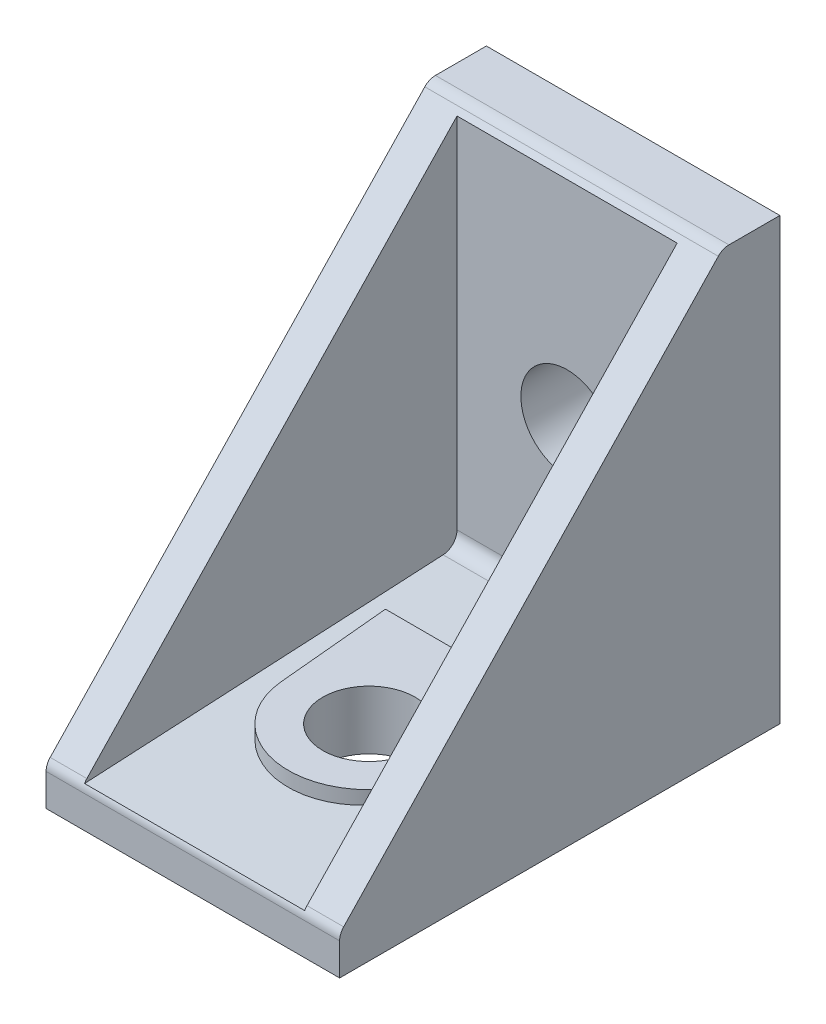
ISO-10303-21;
HEADER;
FILE_DESCRIPTION(('STEP AP214'),'2;1');
FILE_NAME('part.step','',(''),(''),'','','');
FILE_SCHEMA(('AUTOMOTIVE_DESIGN { 1 0 10303 214 1 1 1 1 }'));
ENDSEC;
DATA;
#1=APPLICATION_CONTEXT('core data for automotive mechanical design processes');
#2=APPLICATION_PROTOCOL_DEFINITION('international standard','automotive_design',2000,#1);
#3=PRODUCT_CONTEXT('',#1,'mechanical');
#4=PRODUCT('Part','Part','',(#3));
#5=PRODUCT_RELATED_PRODUCT_CATEGORY('part','',(#4));
#6=PRODUCT_DEFINITION_FORMATION('','',#4);
#7=PRODUCT_DEFINITION_CONTEXT('part definition',#1,'design');
#8=PRODUCT_DEFINITION('design','',#6,#7);
#9=PRODUCT_DEFINITION_SHAPE('','',#8);
#10=(LENGTH_UNIT() NAMED_UNIT(*) SI_UNIT(.MILLI.,.METRE.));
#11=(NAMED_UNIT(*) PLANE_ANGLE_UNIT() SI_UNIT($,.RADIAN.));
#12=(NAMED_UNIT(*) SI_UNIT($,.STERADIAN.) SOLID_ANGLE_UNIT());
#13=UNCERTAINTY_MEASURE_WITH_UNIT(LENGTH_MEASURE(1.E-05),#10,'distance_accuracy_value','');
#14=(GEOMETRIC_REPRESENTATION_CONTEXT(3) GLOBAL_UNCERTAINTY_ASSIGNED_CONTEXT((#13)) GLOBAL_UNIT_ASSIGNED_CONTEXT((#10,
#11,#12)) REPRESENTATION_CONTEXT('',''));
#15=CARTESIAN_POINT('',(0.,0.,0.));
#16=DIRECTION('',(0.,0.,1.));
#17=DIRECTION('',(1.,0.,0.));
#18=AXIS2_PLACEMENT_3D('',#15,#16,#17);
#19=CARTESIAN_POINT('',(3.9,-1.,9.177));
#20=DIRECTION('',(0.,1.,0.));
#21=DIRECTION('',(0.,0.,1.));
#22=AXIS2_PLACEMENT_3D('',#19,#20,#21);
#23=PLANE('',#22);
#24=DIRECTION('',(1.,0.,0.));
#25=VECTOR('',#24,1.);
#26=CARTESIAN_POINT('',(3.9,-1.,4.877));
#27=LINE('',#26,#25);
#28=CARTESIAN_POINT('',(-3.9,-1.,4.877));
#29=VERTEX_POINT('',#28);
#30=CARTESIAN_POINT('',(3.9,-1.,4.877));
#31=VERTEX_POINT('',#30);
#32=EDGE_CURVE('E135',#29,#31,#27,.T.);
#33=ORIENTED_EDGE('',*,*,#32,.T.);
#34=DIRECTION('',(0.,0.,-1.));
#35=VECTOR('',#34,1.);
#36=CARTESIAN_POINT('',(3.9,-1.,0.));
#37=LINE('',#36,#35);
#38=CARTESIAN_POINT('',(3.9,-1.,9.177));
#39=VERTEX_POINT('',#38);
#40=EDGE_CURVE('E378',#39,#31,#37,.T.);
#41=ORIENTED_EDGE('',*,*,#40,.F.);
#42=DIRECTION('',(1.,0.,0.));
#43=VECTOR('',#42,1.);
#44=CARTESIAN_POINT('',(3.9,-1.,9.177));
#45=LINE('',#44,#43);
#46=CARTESIAN_POINT('',(-3.9,-1.,9.177));
#47=VERTEX_POINT('',#46);
#48=EDGE_CURVE('E138',#39,#47,#45,.F.);
#49=ORIENTED_EDGE('',*,*,#48,.T.);
#50=DIRECTION('',(0.,0.,-1.));
#51=VECTOR('',#50,1.);
#52=CARTESIAN_POINT('',(-3.9,-1.,0.));
#53=LINE('',#52,#51);
#54=EDGE_CURVE('E365',#47,#29,#53,.T.);
#55=ORIENTED_EDGE('',*,*,#54,.T.);
#56=EDGE_LOOP('',(#33,#41,#49,#55));
#57=FACE_BOUND('',#56,.T.);
#58=ADVANCED_FACE('F16',(#57),#23,.F.);
#59=CARTESIAN_POINT('',(3.9,-1.,25.677));
#60=DIRECTION('',(0.,1.,0.));
#61=DIRECTION('',(0.,0.,1.));
#62=AXIS2_PLACEMENT_3D('',#59,#60,#61);
#63=PLANE('',#62);
#64=DIRECTION('',(1.,0.,0.));
#65=VECTOR('',#64,1.);
#66=CARTESIAN_POINT('',(3.9,-1.,24.377));
#67=LINE('',#66,#65);
#68=CARTESIAN_POINT('',(-3.9,-1.,24.377));
#69=VERTEX_POINT('',#68);
#70=CARTESIAN_POINT('',(3.9,-1.,24.377));
#71=VERTEX_POINT('',#70);
#72=EDGE_CURVE('E367',#69,#71,#67,.T.);
#73=ORIENTED_EDGE('',*,*,#72,.T.);
#74=DIRECTION('',(0.,0.,-1.));
#75=VECTOR('',#74,1.);
#76=CARTESIAN_POINT('',(3.9,-1.,0.));
#77=LINE('',#76,#75);
#78=CARTESIAN_POINT('',(3.9,-1.,25.677));
#79=VERTEX_POINT('',#78);
#80=EDGE_CURVE('E399',#79,#71,#77,.T.);
#81=ORIENTED_EDGE('',*,*,#80,.F.);
#82=DIRECTION('',(1.,0.,0.));
#83=VECTOR('',#82,1.);
#84=CARTESIAN_POINT('',(3.9,-0.999999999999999,25.677));
#85=LINE('',#84,#83);
#86=CARTESIAN_POINT('',(-3.9,-1.,25.677));
#87=VERTEX_POINT('',#86);
#88=EDGE_CURVE('E391',#79,#87,#85,.F.);
#89=ORIENTED_EDGE('',*,*,#88,.T.);
#90=DIRECTION('',(0.,0.,-1.));
#91=VECTOR('',#90,1.);
#92=CARTESIAN_POINT('',(-3.9,-1.,0.));
#93=LINE('',#92,#91);
#94=EDGE_CURVE('E388',#87,#69,#93,.T.);
#95=ORIENTED_EDGE('',*,*,#94,.T.);
#96=EDGE_LOOP('',(#73,#81,#89,#95));
#97=FACE_BOUND('',#96,.T.);
#98=ADVANCED_FACE('F832',(#97),#63,.F.);
#99=CARTESIAN_POINT('',(10.,2.192,29.));
#100=DIRECTION('',(-1.,0.,0.));
#101=DIRECTION('',(0.,0.,1.));
#102=AXIS2_PLACEMENT_3D('',#99,#100,#101);
#103=CYLINDRICAL_SURFACE('',#102,1.);
#104=CARTESIAN_POINT('',(-7.5,2.192,29.));
#105=DIRECTION('',(-1.,0.,0.));
#106=DIRECTION('',(0.,0.,1.));
#107=AXIS2_PLACEMENT_3D('',#104,#105,#106);
#108=CIRCLE('',#107,1.);
#109=CARTESIAN_POINT('',(-7.5,2.8816207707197,29.7241706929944));
#110=VERTEX_POINT('',#109);
#111=CARTESIAN_POINT('',(-7.5,2.66626901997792,29.8803799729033));
#112=VERTEX_POINT('',#111);
#113=EDGE_CURVE('E66',#110,#112,#108,.F.);
#114=ORIENTED_EDGE('',*,*,#113,.F.);
#115=DIRECTION('',(1.,0.,0.));
#116=VECTOR('',#115,1.);
#117=CARTESIAN_POINT('',(10.,2.88162077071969,29.7241706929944));
#118=LINE('',#117,#116);
#119=CARTESIAN_POINT('',(-10.,2.8816207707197,29.7241706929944));
#120=VERTEX_POINT('',#119);
#121=EDGE_CURVE('E153',#110,#120,#118,.F.);
#122=ORIENTED_EDGE('',*,*,#121,.T.);
#123=CARTESIAN_POINT('',(-10.,2.192,29.));
#124=DIRECTION('',(-1.,0.,0.));
#125=DIRECTION('',(0.,0.,1.));
#126=AXIS2_PLACEMENT_3D('',#123,#124,#125);
#127=CIRCLE('',#126,1.);
#128=CARTESIAN_POINT('',(-10.,2.192,30.));
#129=VERTEX_POINT('',#128);
#130=EDGE_CURVE('E149',#120,#129,#127,.F.);
#131=ORIENTED_EDGE('',*,*,#130,.T.);
#132=DIRECTION('',(1.,0.,0.));
#133=VECTOR('',#132,1.);
#134=CARTESIAN_POINT('',(10.,2.192,30.));
#135=LINE('',#134,#133);
#136=CARTESIAN_POINT('',(10.,2.192,30.));
#137=VERTEX_POINT('',#136);
#138=EDGE_CURVE('E152',#129,#137,#135,.T.);
#139=ORIENTED_EDGE('',*,*,#138,.T.);
#140=CARTESIAN_POINT('',(10.,2.192,29.));
#141=DIRECTION('',(-1.,0.,0.));
#142=DIRECTION('',(0.,0.,1.));
#143=AXIS2_PLACEMENT_3D('',#140,#141,#142);
#144=CIRCLE('',#143,1.);
#145=CARTESIAN_POINT('',(10.,2.8816207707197,29.7241706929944));
#146=VERTEX_POINT('',#145);
#147=EDGE_CURVE('E154',#137,#146,#144,.T.);
#148=ORIENTED_EDGE('',*,*,#147,.T.);
#149=CARTESIAN_POINT('',(7.5,2.88162077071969,29.7241706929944));
#150=VERTEX_POINT('',#149);
#151=EDGE_CURVE('E97',#146,#150,#118,.F.);
#152=ORIENTED_EDGE('',*,*,#151,.T.);
#153=CARTESIAN_POINT('',(7.5,2.192,29.));
#154=DIRECTION('',(-1.,0.,0.));
#155=DIRECTION('',(0.,0.,1.));
#156=AXIS2_PLACEMENT_3D('',#153,#154,#155);
#157=CIRCLE('',#156,1.);
#158=CARTESIAN_POINT('',(7.5,2.66626901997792,29.8803799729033));
#159=VERTEX_POINT('',#158);
#160=EDGE_CURVE('E84',#150,#159,#157,.F.);
#161=ORIENTED_EDGE('',*,*,#160,.T.);
#162=DIRECTION('',(-1.,0.,0.));
#163=VECTOR('',#162,1.);
#164=CARTESIAN_POINT('',(10.,2.66626901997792,29.8803799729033));
#165=LINE('',#164,#163);
#166=EDGE_CURVE('E40',#112,#159,#165,.F.);
#167=ORIENTED_EDGE('',*,*,#166,.F.);
#168=EDGE_LOOP('',(#114,#122,#131,#139,#148,#152,#161,#167));
#169=FACE_BOUND('',#168,.T.);
#170=ADVANCED_FACE('F81',(#169),#103,.T.);
#171=CARTESIAN_POINT('',(7.5,29.,3.471));
#172=DIRECTION('',(-1.,0.,0.));
#173=DIRECTION('',(0.,0.,1.));
#174=AXIS2_PLACEMENT_3D('',#171,#172,#173);
#175=PLANE('',#174);
#176=DIRECTION('',(0.,-1.,0.));
#177=VECTOR('',#176,1.);
#178=CARTESIAN_POINT('',(7.5,30.,4.5));
#179=LINE('',#178,#177);
#180=CARTESIAN_POINT('',(7.5,4.94536293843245,4.5));
#181=VERTEX_POINT('',#180);
#182=CARTESIAN_POINT('',(7.5,29.3695195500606,4.5));
#183=VERTEX_POINT('',#182);
#184=EDGE_CURVE('E190',#181,#183,#179,.F.);
#185=ORIENTED_EDGE('',*,*,#184,.F.);
#186=CARTESIAN_POINT('',(7.5,4.94536293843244,5.5));
#187=DIRECTION('',(-1.,0.,0.));
#188=DIRECTION('',(0.,0.,1.));
#189=AXIS2_PLACEMENT_3D('',#186,#187,#188);
#190=CIRCLE('',#189,1.);
#191=CARTESIAN_POINT('',(7.5,3.94673340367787,5.44766404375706));
#192=VERTEX_POINT('',#191);
#193=EDGE_CURVE('E104',#181,#192,#190,.T.);
#194=ORIENTED_EDGE('',*,*,#193,.T.);
#195=DIRECTION('',(0.,-0.0523359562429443,0.998629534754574));
#196=VECTOR('',#195,1.);
#197=CARTESIAN_POINT('',(7.5,2.66,30.));
#198=LINE('',#197,#196);
#199=EDGE_CURVE('E101',#192,#159,#198,.T.);
#200=ORIENTED_EDGE('',*,*,#199,.T.);
#201=ORIENTED_EDGE('',*,*,#160,.F.);
#202=DIRECTION('',(0.,0.724170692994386,-0.689620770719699));
#203=VECTOR('',#202,1.);
#204=CARTESIAN_POINT('',(7.5,29.6896207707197,4.19517069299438));
#205=LINE('',#204,#203);
#206=EDGE_CURVE('E96',#150,#183,#205,.T.);
#207=ORIENTED_EDGE('',*,*,#206,.T.);
#208=EDGE_LOOP('',(#185,#194,#200,#201,#207));
#209=FACE_BOUND('',#208,.T.);
#210=ADVANCED_FACE('F840',(#209),#175,.T.);
#211=CARTESIAN_POINT('',(-7.5,29.,3.471));
#212=DIRECTION('',(-1.,0.,0.));
#213=DIRECTION('',(0.,0.,1.));
#214=AXIS2_PLACEMENT_3D('',#211,#212,#213);
#215=PLANE('',#214);
#216=CARTESIAN_POINT('',(-7.5,4.94536293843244,5.5));
#217=DIRECTION('',(-1.,0.,0.));
#218=DIRECTION('',(0.,0.,1.));
#219=AXIS2_PLACEMENT_3D('',#216,#217,#218);
#220=CIRCLE('',#219,1.);
#221=CARTESIAN_POINT('',(-7.5,3.94673340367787,5.44766404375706));
#222=VERTEX_POINT('',#221);
#223=CARTESIAN_POINT('',(-7.5,4.94536293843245,4.5));
#224=VERTEX_POINT('',#223);
#225=EDGE_CURVE('E78',#222,#224,#220,.F.);
#226=ORIENTED_EDGE('',*,*,#225,.T.);
#227=DIRECTION('',(0.,-1.,0.));
#228=VECTOR('',#227,1.);
#229=CARTESIAN_POINT('',(-7.5,30.,4.5));
#230=LINE('',#229,#228);
#231=CARTESIAN_POINT('',(-7.50000000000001,29.3695195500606,4.5));
#232=VERTEX_POINT('',#231);
#233=EDGE_CURVE('E223',#232,#224,#230,.T.);
#234=ORIENTED_EDGE('',*,*,#233,.F.);
#235=DIRECTION('',(0.,0.724170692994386,-0.689620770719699));
#236=VECTOR('',#235,1.);
#237=CARTESIAN_POINT('',(-7.50000000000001,29.6896207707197,4.19517069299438));
#238=LINE('',#237,#236);
#239=EDGE_CURVE('E72',#232,#110,#238,.F.);
#240=ORIENTED_EDGE('',*,*,#239,.T.);
#241=ORIENTED_EDGE('',*,*,#113,.T.);
#242=DIRECTION('',(0.,0.0523359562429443,-0.998629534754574));
#243=VECTOR('',#242,1.);
#244=CARTESIAN_POINT('',(-7.5,2.66,30.));
#245=LINE('',#244,#243);
#246=EDGE_CURVE('E69',#112,#222,#245,.T.);
#247=ORIENTED_EDGE('',*,*,#246,.T.);
#248=EDGE_LOOP('',(#226,#234,#240,#241,#247));
#249=FACE_BOUND('',#248,.T.);
#250=ADVANCED_FACE('F68',(#249),#215,.F.);
#251=CARTESIAN_POINT('',(-3.6,18.6,-1.));
#252=DIRECTION('',(0.,0.,-1.));
#253=DIRECTION('',(-1.,0.,0.));
#254=AXIS2_PLACEMENT_3D('',#251,#252,#253);
#255=PLANE('',#254);
#256=CARTESIAN_POINT('',(1.62954617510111,11.4,-1.));
#257=DIRECTION('',(0.,0.,1.));
#258=DIRECTION('',(1.,0.,0.));
#259=AXIS2_PLACEMENT_3D('',#256,#257,#258);
#260=CIRCLE('',#259,0.300000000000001);
#261=CARTESIAN_POINT('',(1.34763838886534,11.2973939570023,-1.));
#262=VERTEX_POINT('',#261);
#263=CARTESIAN_POINT('',(1.62954617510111,11.1,-1.));
#264=VERTEX_POINT('',#263);
#265=EDGE_CURVE('E182',#262,#264,#260,.T.);
#266=ORIENTED_EDGE('',*,*,#265,.F.);
#267=DIRECTION('',(0.342020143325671,-0.939692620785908,0.));
#268=VECTOR('',#267,1.);
#269=CARTESIAN_POINT('',(1.34763838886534,11.2973939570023,-1.));
#270=LINE('',#269,#268);
#271=CARTESIAN_POINT('',(1.07736345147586,12.0399682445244,-1.));
#272=VERTEX_POINT('',#271);
#273=EDGE_CURVE('E326',#272,#262,#270,.T.);
#274=ORIENTED_EDGE('',*,*,#273,.F.);
#275=CARTESIAN_POINT('',(0.,15.,-1.));
#276=DIRECTION('',(0.,0.,1.));
#277=DIRECTION('',(1.,0.,0.));
#278=AXIS2_PLACEMENT_3D('',#275,#276,#277);
#279=CIRCLE('',#278,3.15);
#280=CARTESIAN_POINT('',(2.96003175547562,13.9226365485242,-1.));
#281=VERTEX_POINT('',#280);
#282=EDGE_CURVE('E191',#272,#281,#279,.T.);
#283=ORIENTED_EDGE('',*,*,#282,.T.);
#284=DIRECTION('',(0.93969262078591,-0.342020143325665,0.));
#285=VECTOR('',#284,1.);
#286=CARTESIAN_POINT('',(2.96003175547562,13.9226365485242,-1.));
#287=LINE('',#286,#285);
#288=CARTESIAN_POINT('',(3.7026060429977,13.6523616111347,-1.));
#289=VERTEX_POINT('',#288);
#290=EDGE_CURVE('E161',#281,#289,#287,.T.);
#291=ORIENTED_EDGE('',*,*,#290,.T.);
#292=CARTESIAN_POINT('',(3.6,13.3704538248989,-1.));
#293=DIRECTION('',(0.,0.,1.));
#294=DIRECTION('',(1.,0.,0.));
#295=AXIS2_PLACEMENT_3D('',#292,#293,#294);
#296=CIRCLE('',#295,0.300000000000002);
#297=CARTESIAN_POINT('',(3.9,13.3704538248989,-1.));
#298=VERTEX_POINT('',#297);
#299=EDGE_CURVE('E172',#298,#289,#296,.T.);
#300=ORIENTED_EDGE('',*,*,#299,.F.);
#301=DIRECTION('',(0.,1.,0.));
#302=VECTOR('',#301,1.);
#303=CARTESIAN_POINT('',(3.9,18.6,-1.));
#304=LINE('',#303,#302);
#305=CARTESIAN_POINT('',(3.9,11.4,-1.));
#306=VERTEX_POINT('',#305);
#307=EDGE_CURVE('E320',#306,#298,#304,.T.);
#308=ORIENTED_EDGE('',*,*,#307,.F.);
#309=CARTESIAN_POINT('',(3.6,11.4,-1.));
#310=DIRECTION('',(0.,0.,1.));
#311=DIRECTION('',(1.,0.,0.));
#312=AXIS2_PLACEMENT_3D('',#309,#310,#311);
#313=CIRCLE('',#312,0.300000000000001);
#314=CARTESIAN_POINT('',(3.6,11.1,-1.));
#315=VERTEX_POINT('',#314);
#316=EDGE_CURVE('E177',#315,#306,#313,.T.);
#317=ORIENTED_EDGE('',*,*,#316,.F.);
#318=DIRECTION('',(1.,0.,0.));
#319=VECTOR('',#318,1.);
#320=CARTESIAN_POINT('',(-3.6,11.1,-1.));
#321=LINE('',#320,#319);
#322=EDGE_CURVE('E261',#264,#315,#321,.T.);
#323=ORIENTED_EDGE('',*,*,#322,.F.);
#324=EDGE_LOOP('',(#266,#274,#283,#291,#300,#308,#317,#323));
#325=FACE_BOUND('',#324,.T.);
#326=ADVANCED_FACE('F1262',(#325),#255,.T.);
#327=CARTESIAN_POINT('',(-3.6,18.6,-1.));
#328=DIRECTION('',(0.,0.,-1.));
#329=DIRECTION('',(-1.,0.,0.));
#330=AXIS2_PLACEMENT_3D('',#327,#328,#329);
#331=PLANE('',#330);
#332=CARTESIAN_POINT('',(-3.6,13.3704538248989,-1.));
#333=DIRECTION('',(0.,0.,1.));
#334=DIRECTION('',(1.,0.,0.));
#335=AXIS2_PLACEMENT_3D('',#332,#333,#334);
#336=CIRCLE('',#335,0.300000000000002);
#337=CARTESIAN_POINT('',(-3.9,13.3704538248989,-1.));
#338=VERTEX_POINT('',#337);
#339=CARTESIAN_POINT('',(-3.7026060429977,13.6523616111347,-1.));
#340=VERTEX_POINT('',#339);
#341=EDGE_CURVE('E157',#338,#340,#336,.F.);
#342=ORIENTED_EDGE('',*,*,#341,.T.);
#343=DIRECTION('',(0.939692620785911,0.342020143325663,0.));
#344=VECTOR('',#343,1.);
#345=CARTESIAN_POINT('',(-3.7026060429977,13.6523616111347,-1.));
#346=LINE('',#345,#344);
#347=CARTESIAN_POINT('',(-2.96003175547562,13.9226365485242,-1.));
#348=VERTEX_POINT('',#347);
#349=EDGE_CURVE('E160',#340,#348,#346,.T.);
#350=ORIENTED_EDGE('',*,*,#349,.T.);
#351=CARTESIAN_POINT('',(0.,15.,-1.));
#352=DIRECTION('',(0.,0.,1.));
#353=DIRECTION('',(1.,0.,0.));
#354=AXIS2_PLACEMENT_3D('',#351,#352,#353);
#355=CIRCLE('',#354,3.15);
#356=CARTESIAN_POINT('',(-1.07736345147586,12.0399682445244,-1.));
#357=VERTEX_POINT('',#356);
#358=EDGE_CURVE('E187',#348,#357,#355,.T.);
#359=ORIENTED_EDGE('',*,*,#358,.T.);
#360=DIRECTION('',(0.342020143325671,0.939692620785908,0.));
#361=VECTOR('',#360,1.);
#362=CARTESIAN_POINT('',(-1.34763838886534,11.2973939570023,-1.));
#363=LINE('',#362,#361);
#364=CARTESIAN_POINT('',(-1.34763838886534,11.2973939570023,-1.));
#365=VERTEX_POINT('',#364);
#366=EDGE_CURVE('E329',#365,#357,#363,.T.);
#367=ORIENTED_EDGE('',*,*,#366,.F.);
#368=CARTESIAN_POINT('',(-1.62954617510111,11.4,-1.));
#369=DIRECTION('',(0.,0.,1.));
#370=DIRECTION('',(1.,0.,0.));
#371=AXIS2_PLACEMENT_3D('',#368,#369,#370);
#372=CIRCLE('',#371,0.300000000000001);
#373=CARTESIAN_POINT('',(-1.62954617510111,11.1,-1.));
#374=VERTEX_POINT('',#373);
#375=EDGE_CURVE('E194',#374,#365,#372,.T.);
#376=ORIENTED_EDGE('',*,*,#375,.F.);
#377=DIRECTION('',(1.,0.,0.));
#378=VECTOR('',#377,1.);
#379=CARTESIAN_POINT('',(-3.6,11.1,-1.));
#380=LINE('',#379,#378);
#381=CARTESIAN_POINT('',(-3.6,11.1,-1.));
#382=VERTEX_POINT('',#381);
#383=EDGE_CURVE('E336',#382,#374,#380,.T.);
#384=ORIENTED_EDGE('',*,*,#383,.F.);
#385=CARTESIAN_POINT('',(-3.6,11.4,-1.));
#386=DIRECTION('',(0.,0.,1.));
#387=DIRECTION('',(1.,0.,0.));
#388=AXIS2_PLACEMENT_3D('',#385,#386,#387);
#389=CIRCLE('',#388,0.300000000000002);
#390=CARTESIAN_POINT('',(-3.9,11.4,-1.));
#391=VERTEX_POINT('',#390);
#392=EDGE_CURVE('E199',#391,#382,#389,.T.);
#393=ORIENTED_EDGE('',*,*,#392,.F.);
#394=DIRECTION('',(0.,-1.,0.));
#395=VECTOR('',#394,1.);
#396=CARTESIAN_POINT('',(-3.9,18.6,-1.));
#397=LINE('',#396,#395);
#398=EDGE_CURVE('E273',#338,#391,#397,.T.);
#399=ORIENTED_EDGE('',*,*,#398,.F.);
#400=EDGE_LOOP('',(#342,#350,#359,#367,#376,#384,#393,#399));
#401=FACE_BOUND('',#400,.T.);
#402=ADVANCED_FACE('F920',(#401),#331,.T.);
#403=CARTESIAN_POINT('',(10.,30.,4.5));
#404=DIRECTION('',(0.,0.,1.));
#405=DIRECTION('',(0.,-1.,0.));
#406=AXIS2_PLACEMENT_3D('',#403,#404,#405);
#407=PLANE('',#406);
#408=ORIENTED_EDGE('',*,*,#184,.T.);
#409=DIRECTION('',(1.,0.,0.));
#410=VECTOR('',#409,1.);
#411=CARTESIAN_POINT('',(10.,29.3695195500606,4.5));
#412=LINE('',#411,#410);
#413=EDGE_CURVE('E313',#183,#232,#412,.F.);
#414=ORIENTED_EDGE('',*,*,#413,.T.);
#415=ORIENTED_EDGE('',*,*,#233,.T.);
#416=DIRECTION('',(1.,0.,0.));
#417=VECTOR('',#416,1.);
#418=CARTESIAN_POINT('',(-33.1520627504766,4.94536293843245,4.5));
#419=LINE('',#418,#417);
#420=EDGE_CURVE('E99',#224,#181,#419,.T.);
#421=ORIENTED_EDGE('',*,*,#420,.T.);
#422=EDGE_LOOP('',(#408,#414,#415,#421));
#423=FACE_BOUND('',#422,.T.);
#424=CARTESIAN_POINT('',(0.,15.,4.5));
#425=DIRECTION('',(0.,0.,1.));
#426=DIRECTION('',(1.,0.,0.));
#427=AXIS2_PLACEMENT_3D('',#424,#425,#426);
#428=CIRCLE('',#427,3.15);
#429=CARTESIAN_POINT('',(3.15,15.,4.5));
#430=VERTEX_POINT('',#429);
#431=EDGE_CURVE('E219',#430,#430,#428,.F.);
#432=ORIENTED_EDGE('',*,*,#431,.T.);
#433=EDGE_LOOP('',(#432));
#434=FACE_BOUND('',#433,.T.);
#435=ADVANCED_FACE('F1280',(#423,#434),#407,.T.);
#436=CARTESIAN_POINT('',(-3.6,18.6,-1.));
#437=DIRECTION('',(0.,0.,-1.));
#438=DIRECTION('',(-1.,0.,0.));
#439=AXIS2_PLACEMENT_3D('',#436,#437,#438);
#440=PLANE('',#439);
#441=CARTESIAN_POINT('',(-1.62954617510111,18.6,-1.));
#442=DIRECTION('',(0.,0.,1.));
#443=DIRECTION('',(1.,0.,0.));
#444=AXIS2_PLACEMENT_3D('',#441,#442,#443);
#445=CIRCLE('',#444,0.300000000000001);
#446=CARTESIAN_POINT('',(-1.34763838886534,18.7026060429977,-1.));
#447=VERTEX_POINT('',#446);
#448=CARTESIAN_POINT('',(-1.62954617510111,18.9,-1.));
#449=VERTEX_POINT('',#448);
#450=EDGE_CURVE('E214',#447,#449,#445,.T.);
#451=ORIENTED_EDGE('',*,*,#450,.F.);
#452=DIRECTION('',(0.342020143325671,-0.939692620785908,0.));
#453=VECTOR('',#452,1.);
#454=CARTESIAN_POINT('',(-1.34763838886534,18.7026060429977,-1.));
#455=LINE('',#454,#453);
#456=CARTESIAN_POINT('',(-1.07736345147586,17.9600317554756,-1.));
#457=VERTEX_POINT('',#456);
#458=EDGE_CURVE('E222',#447,#457,#455,.T.);
#459=ORIENTED_EDGE('',*,*,#458,.T.);
#460=CARTESIAN_POINT('',(0.,15.,-1.));
#461=DIRECTION('',(0.,0.,1.));
#462=DIRECTION('',(1.,0.,0.));
#463=AXIS2_PLACEMENT_3D('',#460,#461,#462);
#464=CIRCLE('',#463,3.15);
#465=CARTESIAN_POINT('',(-2.96003175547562,16.0773634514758,-1.));
#466=VERTEX_POINT('',#465);
#467=EDGE_CURVE('E231',#457,#466,#464,.T.);
#468=ORIENTED_EDGE('',*,*,#467,.T.);
#469=DIRECTION('',(-0.939692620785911,0.342020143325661,0.));
#470=VECTOR('',#469,1.);
#471=CARTESIAN_POINT('',(-3.7026060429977,16.3476383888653,-1.));
#472=LINE('',#471,#470);
#473=CARTESIAN_POINT('',(-3.7026060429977,16.3476383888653,-1.));
#474=VERTEX_POINT('',#473);
#475=EDGE_CURVE('E166',#466,#474,#472,.T.);
#476=ORIENTED_EDGE('',*,*,#475,.T.);
#477=CARTESIAN_POINT('',(-3.6,16.6295461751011,-1.));
#478=DIRECTION('',(0.,0.,1.));
#479=DIRECTION('',(1.,0.,0.));
#480=AXIS2_PLACEMENT_3D('',#477,#478,#479);
#481=CIRCLE('',#480,0.300000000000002);
#482=CARTESIAN_POINT('',(-3.9,16.6295461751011,-1.));
#483=VERTEX_POINT('',#482);
#484=EDGE_CURVE('E204',#483,#474,#481,.T.);
#485=ORIENTED_EDGE('',*,*,#484,.F.);
#486=DIRECTION('',(0.,-1.,0.));
#487=VECTOR('',#486,1.);
#488=CARTESIAN_POINT('',(-3.9,18.6,-1.));
#489=LINE('',#488,#487);
#490=CARTESIAN_POINT('',(-3.9,18.6,-1.));
#491=VERTEX_POINT('',#490);
#492=EDGE_CURVE('E286',#491,#483,#489,.T.);
#493=ORIENTED_EDGE('',*,*,#492,.F.);
#494=CARTESIAN_POINT('',(-3.6,18.6,-1.));
#495=DIRECTION('',(0.,0.,1.));
#496=DIRECTION('',(1.,0.,0.));
#497=AXIS2_PLACEMENT_3D('',#494,#495,#496);
#498=CIRCLE('',#497,0.300000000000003);
#499=CARTESIAN_POINT('',(-3.6,18.9,-1.));
#500=VERTEX_POINT('',#499);
#501=EDGE_CURVE('E209',#500,#491,#498,.T.);
#502=ORIENTED_EDGE('',*,*,#501,.F.);
#503=DIRECTION('',(1.,0.,0.));
#504=VECTOR('',#503,1.);
#505=CARTESIAN_POINT('',(-3.6,18.9,-1.));
#506=LINE('',#505,#504);
#507=EDGE_CURVE('E290',#449,#500,#506,.F.);
#508=ORIENTED_EDGE('',*,*,#507,.F.);
#509=EDGE_LOOP('',(#451,#459,#468,#476,#485,#493,#502,#508));
#510=FACE_BOUND('',#509,.T.);
#511=ADVANCED_FACE('F1289',(#510),#440,.T.);
#512=CARTESIAN_POINT('',(-3.6,18.6,-1.));
#513=DIRECTION('',(0.,0.,-1.));
#514=DIRECTION('',(-1.,0.,0.));
#515=AXIS2_PLACEMENT_3D('',#512,#513,#514);
#516=PLANE('',#515);
#517=CARTESIAN_POINT('',(3.6,16.6295461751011,-1.));
#518=DIRECTION('',(0.,0.,1.));
#519=DIRECTION('',(1.,0.,0.));
#520=AXIS2_PLACEMENT_3D('',#517,#518,#519);
#521=CIRCLE('',#520,0.300000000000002);
#522=CARTESIAN_POINT('',(3.9,16.6295461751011,-1.));
#523=VERTEX_POINT('',#522);
#524=CARTESIAN_POINT('',(3.7026060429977,16.3476383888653,-1.));
#525=VERTEX_POINT('',#524);
#526=EDGE_CURVE('E162',#523,#525,#521,.F.);
#527=ORIENTED_EDGE('',*,*,#526,.T.);
#528=DIRECTION('',(-0.939692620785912,-0.34202014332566,0.));
#529=VECTOR('',#528,1.);
#530=CARTESIAN_POINT('',(3.7026060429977,16.3476383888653,-1.));
#531=LINE('',#530,#529);
#532=CARTESIAN_POINT('',(2.96003175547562,16.0773634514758,-1.));
#533=VERTEX_POINT('',#532);
#534=EDGE_CURVE('E165',#525,#533,#531,.T.);
#535=ORIENTED_EDGE('',*,*,#534,.T.);
#536=CARTESIAN_POINT('',(0.,15.,-1.));
#537=DIRECTION('',(0.,0.,1.));
#538=DIRECTION('',(1.,0.,0.));
#539=AXIS2_PLACEMENT_3D('',#536,#537,#538);
#540=CIRCLE('',#539,3.15);
#541=CARTESIAN_POINT('',(1.07736345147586,17.9600317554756,-1.));
#542=VERTEX_POINT('',#541);
#543=EDGE_CURVE('E227',#533,#542,#540,.T.);
#544=ORIENTED_EDGE('',*,*,#543,.T.);
#545=DIRECTION('',(0.342020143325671,0.939692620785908,0.));
#546=VECTOR('',#545,1.);
#547=CARTESIAN_POINT('',(1.34763838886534,18.7026060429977,-1.));
#548=LINE('',#547,#546);
#549=CARTESIAN_POINT('',(1.34763838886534,18.7026060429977,-1.));
#550=VERTEX_POINT('',#549);
#551=EDGE_CURVE('E230',#542,#550,#548,.T.);
#552=ORIENTED_EDGE('',*,*,#551,.T.);
#553=CARTESIAN_POINT('',(1.62954617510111,18.6,-1.));
#554=DIRECTION('',(0.,0.,1.));
#555=DIRECTION('',(1.,0.,0.));
#556=AXIS2_PLACEMENT_3D('',#553,#554,#555);
#557=CIRCLE('',#556,0.300000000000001);
#558=CARTESIAN_POINT('',(1.62954617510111,18.9,-1.));
#559=VERTEX_POINT('',#558);
#560=EDGE_CURVE('E234',#559,#550,#557,.T.);
#561=ORIENTED_EDGE('',*,*,#560,.F.);
#562=DIRECTION('',(1.,0.,0.));
#563=VECTOR('',#562,1.);
#564=CARTESIAN_POINT('',(-3.6,18.9,-1.));
#565=LINE('',#564,#563);
#566=CARTESIAN_POINT('',(3.6,18.9,-1.));
#567=VERTEX_POINT('',#566);
#568=EDGE_CURVE('E301',#567,#559,#565,.F.);
#569=ORIENTED_EDGE('',*,*,#568,.F.);
#570=CARTESIAN_POINT('',(3.6,18.6,-1.));
#571=DIRECTION('',(0.,0.,1.));
#572=DIRECTION('',(1.,0.,0.));
#573=AXIS2_PLACEMENT_3D('',#570,#571,#572);
#574=CIRCLE('',#573,0.300000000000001);
#575=CARTESIAN_POINT('',(3.9,18.6,-1.));
#576=VERTEX_POINT('',#575);
#577=EDGE_CURVE('E239',#576,#567,#574,.T.);
#578=ORIENTED_EDGE('',*,*,#577,.F.);
#579=DIRECTION('',(0.,1.,0.));
#580=VECTOR('',#579,1.);
#581=CARTESIAN_POINT('',(3.9,18.6,-1.));
#582=LINE('',#581,#580);
#583=EDGE_CURVE('E310',#523,#576,#582,.T.);
#584=ORIENTED_EDGE('',*,*,#583,.F.);
#585=EDGE_LOOP('',(#527,#535,#544,#552,#561,#569,#578,#584));
#586=FACE_BOUND('',#585,.T.);
#587=ADVANCED_FACE('F986',(#586),#516,.T.);
#588=CARTESIAN_POINT('',(0.,30.001,18.));
#589=DIRECTION('',(0.,-1.,0.));
#590=DIRECTION('',(0.,0.,-1.));
#591=AXIS2_PLACEMENT_3D('',#588,#589,#590);
#592=CYLINDRICAL_SURFACE('',#591,3.15);
#593=CARTESIAN_POINT('',(0.,4.,18.));
#594=DIRECTION('',(0.,1.,0.));
#595=DIRECTION('',(0.,0.,1.));
#596=AXIS2_PLACEMENT_3D('',#593,#594,#595);
#597=CIRCLE('',#596,3.15);
#598=CARTESIAN_POINT('',(0.,4.,21.15));
#599=VERTEX_POINT('',#598);
#600=EDGE_CURVE('E888',#599,#599,#597,.T.);
#601=ORIENTED_EDGE('',*,*,#600,.T.);
#602=EDGE_LOOP('',(#601));
#603=FACE_BOUND('',#602,.T.);
#604=CARTESIAN_POINT('',(0.,0.,18.));
#605=DIRECTION('',(0.,-1.,0.));
#606=DIRECTION('',(0.,0.,-1.));
#607=AXIS2_PLACEMENT_3D('',#604,#605,#606);
#608=CIRCLE('',#607,3.15);
#609=CARTESIAN_POINT('',(0.,0.,14.85));
#610=VERTEX_POINT('',#609);
#611=EDGE_CURVE('E244',#610,#610,#608,.T.);
#612=ORIENTED_EDGE('',*,*,#611,.T.);
#613=EDGE_LOOP('',(#612));
#614=FACE_BOUND('',#613,.T.);
#615=ADVANCED_FACE('F18',(#603,#614),#592,.F.);
#616=CARTESIAN_POINT('',(-3.9,0.,0.));
#617=DIRECTION('',(1.,0.,0.));
#618=DIRECTION('',(0.,0.,-1.));
#619=AXIS2_PLACEMENT_3D('',#616,#617,#618);
#620=PLANE('',#619);
#621=ORIENTED_EDGE('',*,*,#54,.F.);
#622=DIRECTION('',(0.,0.866025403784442,0.499999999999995));
#623=VECTOR('',#622,1.);
#624=CARTESIAN_POINT('',(-3.9,0.,9.75435026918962));
#625=LINE('',#624,#623);
#626=CARTESIAN_POINT('',(-3.9,0.,9.75435026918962));
#627=VERTEX_POINT('',#626);
#628=EDGE_CURVE('E247',#47,#627,#625,.T.);
#629=ORIENTED_EDGE('',*,*,#628,.T.);
#630=DIRECTION('',(0.,0.,1.));
#631=VECTOR('',#630,1.);
#632=CARTESIAN_POINT('',(-3.9,0.,0.));
#633=LINE('',#632,#631);
#634=CARTESIAN_POINT('',(-3.9,0.,4.29964973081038));
#635=VERTEX_POINT('',#634);
#636=EDGE_CURVE('E373',#627,#635,#633,.F.);
#637=ORIENTED_EDGE('',*,*,#636,.T.);
#638=DIRECTION('',(0.,-0.866025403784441,0.499999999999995));
#639=VECTOR('',#638,1.);
#640=CARTESIAN_POINT('',(-3.9,-1.,4.877));
#641=LINE('',#640,#639);
#642=EDGE_CURVE('E369',#635,#29,#641,.T.);
#643=ORIENTED_EDGE('',*,*,#642,.T.);
#644=EDGE_LOOP('',(#621,#629,#637,#643));
#645=FACE_BOUND('',#644,.T.);
#646=ADVANCED_FACE('F1317',(#645),#620,.F.);
#647=CARTESIAN_POINT('',(3.9,-1.,4.877));
#648=DIRECTION('',(0.,0.499999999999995,0.866025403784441));
#649=DIRECTION('',(0.,-0.866025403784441,0.499999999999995));
#650=AXIS2_PLACEMENT_3D('',#647,#648,#649);
#651=PLANE('',#650);
#652=DIRECTION('',(1.,0.,0.));
#653=VECTOR('',#652,1.);
#654=CARTESIAN_POINT('',(10.,0.,4.29964973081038));
#655=LINE('',#654,#653);
#656=CARTESIAN_POINT('',(3.9,0.,4.29964973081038));
#657=VERTEX_POINT('',#656);
#658=EDGE_CURVE('E372',#635,#657,#655,.T.);
#659=ORIENTED_EDGE('',*,*,#658,.T.);
#660=DIRECTION('',(0.,0.866025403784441,-0.499999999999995));
#661=VECTOR('',#660,1.);
#662=CARTESIAN_POINT('',(3.9,-1.,4.877));
#663=LINE('',#662,#661);
#664=EDGE_CURVE('E374',#31,#657,#663,.T.);
#665=ORIENTED_EDGE('',*,*,#664,.F.);
#666=ORIENTED_EDGE('',*,*,#32,.F.);
#667=ORIENTED_EDGE('',*,*,#642,.F.);
#668=EDGE_LOOP('',(#659,#665,#666,#667));
#669=FACE_BOUND('',#668,.T.);
#670=ADVANCED_FACE('F1325',(#669),#651,.F.);
#671=CARTESIAN_POINT('',(3.9,0.,0.));
#672=DIRECTION('',(1.,0.,0.));
#673=DIRECTION('',(0.,0.,-1.));
#674=AXIS2_PLACEMENT_3D('',#671,#672,#673);
#675=PLANE('',#674);
#676=DIRECTION('',(0.,0.866025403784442,0.499999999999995));
#677=VECTOR('',#676,1.);
#678=CARTESIAN_POINT('',(3.9,0.,9.75435026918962));
#679=LINE('',#678,#677);
#680=CARTESIAN_POINT('',(3.9,0.,9.75435026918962));
#681=VERTEX_POINT('',#680);
#682=EDGE_CURVE('E381',#681,#39,#679,.F.);
#683=ORIENTED_EDGE('',*,*,#682,.T.);
#684=ORIENTED_EDGE('',*,*,#40,.T.);
#685=ORIENTED_EDGE('',*,*,#664,.T.);
#686=DIRECTION('',(0.,0.,1.));
#687=VECTOR('',#686,1.);
#688=CARTESIAN_POINT('',(3.9,0.,0.));
#689=LINE('',#688,#687);
#690=EDGE_CURVE('E377',#657,#681,#689,.T.);
#691=ORIENTED_EDGE('',*,*,#690,.T.);
#692=EDGE_LOOP('',(#683,#684,#685,#691));
#693=FACE_BOUND('',#692,.T.);
#694=ADVANCED_FACE('F1335',(#693),#675,.T.);
#695=CARTESIAN_POINT('',(3.9,0.,9.75435026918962));
#696=DIRECTION('',(0.,0.499999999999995,-0.866025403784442));
#697=DIRECTION('',(0.,0.866025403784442,0.499999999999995));
#698=AXIS2_PLACEMENT_3D('',#695,#696,#697);
#699=PLANE('',#698);
#700=ORIENTED_EDGE('',*,*,#48,.F.);
#701=ORIENTED_EDGE('',*,*,#682,.F.);
#702=DIRECTION('',(1.,0.,0.));
#703=VECTOR('',#702,1.);
#704=CARTESIAN_POINT('',(10.,0.,9.75435026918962));
#705=LINE('',#704,#703);
#706=EDGE_CURVE('E529',#681,#627,#705,.F.);
#707=ORIENTED_EDGE('',*,*,#706,.T.);
#708=ORIENTED_EDGE('',*,*,#628,.F.);
#709=EDGE_LOOP('',(#700,#701,#707,#708));
#710=FACE_BOUND('',#709,.T.);
#711=ADVANCED_FACE('F1345',(#710),#699,.F.);
#712=CARTESIAN_POINT('',(-3.9,0.,0.));
#713=DIRECTION('',(1.,0.,0.));
#714=DIRECTION('',(0.,0.,-1.));
#715=AXIS2_PLACEMENT_3D('',#712,#713,#714);
#716=PLANE('',#715);
#717=DIRECTION('',(0.,0.,1.));
#718=VECTOR('',#717,1.);
#719=CARTESIAN_POINT('',(-3.9,0.,0.));
#720=LINE('',#719,#718);
#721=CARTESIAN_POINT('',(-3.9,0.,26.2543502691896));
#722=VERTEX_POINT('',#721);
#723=CARTESIAN_POINT('',(-3.9,0.,23.7996497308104));
#724=VERTEX_POINT('',#723);
#725=EDGE_CURVE('E398',#722,#724,#720,.F.);
#726=ORIENTED_EDGE('',*,*,#725,.T.);
#727=DIRECTION('',(0.,-0.86602540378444,0.499999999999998));
#728=VECTOR('',#727,1.);
#729=CARTESIAN_POINT('',(-3.9,-1.,24.377));
#730=LINE('',#729,#728);
#731=EDGE_CURVE('E394',#724,#69,#730,.T.);
#732=ORIENTED_EDGE('',*,*,#731,.T.);
#733=ORIENTED_EDGE('',*,*,#94,.F.);
#734=DIRECTION('',(0.,0.86602540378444,0.499999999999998));
#735=VECTOR('',#734,1.);
#736=CARTESIAN_POINT('',(-3.9,0.,26.2543502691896));
#737=LINE('',#736,#735);
#738=EDGE_CURVE('E397',#87,#722,#737,.T.);
#739=ORIENTED_EDGE('',*,*,#738,.T.);
#740=EDGE_LOOP('',(#726,#732,#733,#739));
#741=FACE_BOUND('',#740,.T.);
#742=ADVANCED_FACE('F830',(#741),#716,.F.);
#743=CARTESIAN_POINT('',(3.9,-1.,24.377));
#744=DIRECTION('',(0.,0.499999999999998,0.86602540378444));
#745=DIRECTION('',(0.,-0.86602540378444,0.499999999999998));
#746=AXIS2_PLACEMENT_3D('',#743,#744,#745);
#747=PLANE('',#746);
#748=DIRECTION('',(1.,0.,0.));
#749=VECTOR('',#748,1.);
#750=CARTESIAN_POINT('',(10.,0.,23.7996497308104));
#751=LINE('',#750,#749);
#752=CARTESIAN_POINT('',(3.9,0.,23.7996497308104));
#753=VERTEX_POINT('',#752);
#754=EDGE_CURVE('E407',#724,#753,#751,.T.);
#755=ORIENTED_EDGE('',*,*,#754,.T.);
#756=DIRECTION('',(0.,0.86602540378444,-0.499999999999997));
#757=VECTOR('',#756,1.);
#758=CARTESIAN_POINT('',(3.9,-1.,24.377));
#759=LINE('',#758,#757);
#760=EDGE_CURVE('E403',#71,#753,#759,.T.);
#761=ORIENTED_EDGE('',*,*,#760,.F.);
#762=ORIENTED_EDGE('',*,*,#72,.F.);
#763=ORIENTED_EDGE('',*,*,#731,.F.);
#764=EDGE_LOOP('',(#755,#761,#762,#763));
#765=FACE_BOUND('',#764,.T.);
#766=ADVANCED_FACE('F828',(#765),#747,.F.);
#767=CARTESIAN_POINT('',(3.9,0.,0.));
#768=DIRECTION('',(1.,0.,0.));
#769=DIRECTION('',(0.,0.,-1.));
#770=AXIS2_PLACEMENT_3D('',#767,#768,#769);
#771=PLANE('',#770);
#772=ORIENTED_EDGE('',*,*,#760,.T.);
#773=DIRECTION('',(0.,0.,1.));
#774=VECTOR('',#773,1.);
#775=CARTESIAN_POINT('',(3.9,0.,0.));
#776=LINE('',#775,#774);
#777=CARTESIAN_POINT('',(3.9,0.,26.2543502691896));
#778=VERTEX_POINT('',#777);
#779=EDGE_CURVE('E406',#753,#778,#776,.T.);
#780=ORIENTED_EDGE('',*,*,#779,.T.);
#781=DIRECTION('',(0.,0.86602540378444,0.499999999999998));
#782=VECTOR('',#781,1.);
#783=CARTESIAN_POINT('',(3.9,0.,26.2543502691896));
#784=LINE('',#783,#782);
#785=EDGE_CURVE('E402',#778,#79,#784,.F.);
#786=ORIENTED_EDGE('',*,*,#785,.T.);
#787=ORIENTED_EDGE('',*,*,#80,.T.);
#788=EDGE_LOOP('',(#772,#780,#786,#787));
#789=FACE_BOUND('',#788,.T.);
#790=ADVANCED_FACE('F825',(#789),#771,.T.);
#791=CARTESIAN_POINT('',(3.9,0.,26.2543502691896));
#792=DIRECTION('',(0.,0.499999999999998,-0.86602540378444));
#793=DIRECTION('',(0.,0.86602540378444,0.499999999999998));
#794=AXIS2_PLACEMENT_3D('',#791,#792,#793);
#795=PLANE('',#794);
#796=ORIENTED_EDGE('',*,*,#88,.F.);
#797=ORIENTED_EDGE('',*,*,#785,.F.);
#798=DIRECTION('',(1.,0.,0.));
#799=VECTOR('',#798,1.);
#800=CARTESIAN_POINT('',(10.,0.,26.2543502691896));
#801=LINE('',#800,#799);
#802=EDGE_CURVE('E251',#778,#722,#801,.F.);
#803=ORIENTED_EDGE('',*,*,#802,.T.);
#804=ORIENTED_EDGE('',*,*,#738,.F.);
#805=EDGE_LOOP('',(#796,#797,#803,#804));
#806=FACE_BOUND('',#805,.T.);
#807=ADVANCED_FACE('F817',(#806),#795,.F.);
#808=CARTESIAN_POINT('',(10.,29.,3.471));
#809=DIRECTION('',(-1.,0.,0.));
#810=DIRECTION('',(0.,0.,1.));
#811=AXIS2_PLACEMENT_3D('',#808,#809,#810);
#812=CYLINDRICAL_SURFACE('',#811,0.999999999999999);
#813=CARTESIAN_POINT('',(10.,29.,3.471));
#814=DIRECTION('',(-1.,0.,0.));
#815=DIRECTION('',(0.,0.,1.));
#816=AXIS2_PLACEMENT_3D('',#813,#814,#815);
#817=CIRCLE('',#816,0.999999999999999);
#818=CARTESIAN_POINT('',(10.,29.6896207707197,4.19517069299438));
#819=VERTEX_POINT('',#818);
#820=CARTESIAN_POINT('',(10.,30.,3.471));
#821=VERTEX_POINT('',#820);
#822=EDGE_CURVE('E248',#819,#821,#817,.T.);
#823=ORIENTED_EDGE('',*,*,#822,.T.);
#824=DIRECTION('',(1.,0.,0.));
#825=VECTOR('',#824,1.);
#826=CARTESIAN_POINT('',(10.,30.,3.471));
#827=LINE('',#826,#825);
#828=CARTESIAN_POINT('',(-10.,30.,3.471));
#829=VERTEX_POINT('',#828);
#830=EDGE_CURVE('E171',#821,#829,#827,.F.);
#831=ORIENTED_EDGE('',*,*,#830,.T.);
#832=CARTESIAN_POINT('',(-10.,29.,3.471));
#833=DIRECTION('',(-1.,0.,0.));
#834=DIRECTION('',(0.,0.,1.));
#835=AXIS2_PLACEMENT_3D('',#832,#833,#834);
#836=CIRCLE('',#835,0.999999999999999);
#837=CARTESIAN_POINT('',(-10.,29.6896207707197,4.19517069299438));
#838=VERTEX_POINT('',#837);
#839=EDGE_CURVE('E167',#829,#838,#836,.F.);
#840=ORIENTED_EDGE('',*,*,#839,.T.);
#841=DIRECTION('',(1.,0.,0.));
#842=VECTOR('',#841,1.);
#843=CARTESIAN_POINT('',(10.,29.6896207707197,4.19517069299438));
#844=LINE('',#843,#842);
#845=EDGE_CURVE('E170',#838,#819,#844,.T.);
#846=ORIENTED_EDGE('',*,*,#845,.T.);
#847=EDGE_LOOP('',(#823,#831,#840,#846));
#848=FACE_BOUND('',#847,.T.);
#849=ADVANCED_FACE('F1044',(#848),#812,.T.);
#850=CARTESIAN_POINT('',(10.,2.192,30.));
#851=DIRECTION('',(0.,0.,-1.));
#852=DIRECTION('',(0.,1.,0.));
#853=AXIS2_PLACEMENT_3D('',#850,#851,#852);
#854=PLANE('',#853);
#855=DIRECTION('',(1.,0.,0.));
#856=VECTOR('',#855,1.);
#857=CARTESIAN_POINT('',(10.,0.,30.));
#858=LINE('',#857,#856);
#859=CARTESIAN_POINT('',(-10.,0.,30.));
#860=VERTEX_POINT('',#859);
#861=CARTESIAN_POINT('',(10.,0.,30.));
#862=VERTEX_POINT('',#861);
#863=EDGE_CURVE('E437',#860,#862,#858,.T.);
#864=ORIENTED_EDGE('',*,*,#863,.T.);
#865=DIRECTION('',(0.,1.,0.));
#866=VECTOR('',#865,1.);
#867=CARTESIAN_POINT('',(10.,29.,30.));
#868=LINE('',#867,#866);
#869=EDGE_CURVE('E440',#862,#137,#868,.T.);
#870=ORIENTED_EDGE('',*,*,#869,.T.);
#871=ORIENTED_EDGE('',*,*,#138,.F.);
#872=DIRECTION('',(0.,1.,0.));
#873=VECTOR('',#872,1.);
#874=CARTESIAN_POINT('',(-10.,29.,30.));
#875=LINE('',#874,#873);
#876=EDGE_CURVE('E226',#860,#129,#875,.T.);
#877=ORIENTED_EDGE('',*,*,#876,.F.);
#878=EDGE_LOOP('',(#864,#870,#871,#877));
#879=FACE_BOUND('',#878,.T.);
#880=ADVANCED_FACE('F1050',(#879),#854,.F.);
#881=CARTESIAN_POINT('',(10.,29.6896207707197,4.19517069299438));
#882=DIRECTION('',(0.,-0.689620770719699,-0.724170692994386));
#883=DIRECTION('',(0.,0.724170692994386,-0.689620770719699));
#884=AXIS2_PLACEMENT_3D('',#881,#882,#883);
#885=PLANE('',#884);
#886=ORIENTED_EDGE('',*,*,#121,.F.);
#887=ORIENTED_EDGE('',*,*,#239,.F.);
#888=ORIENTED_EDGE('',*,*,#413,.F.);
#889=ORIENTED_EDGE('',*,*,#206,.F.);
#890=ORIENTED_EDGE('',*,*,#151,.F.);
#891=DIRECTION('',(0.,0.724170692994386,-0.689620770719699));
#892=VECTOR('',#891,1.);
#893=CARTESIAN_POINT('',(10.,2.8816207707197,29.7241706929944));
#894=LINE('',#893,#892);
#895=EDGE_CURVE('E254',#146,#819,#894,.T.);
#896=ORIENTED_EDGE('',*,*,#895,.T.);
#897=ORIENTED_EDGE('',*,*,#845,.F.);
#898=DIRECTION('',(0.,0.724170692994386,-0.689620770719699));
#899=VECTOR('',#898,1.);
#900=CARTESIAN_POINT('',(-10.,2.8816207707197,29.7241706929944));
#901=LINE('',#900,#899);
#902=EDGE_CURVE('E427',#120,#838,#901,.T.);
#903=ORIENTED_EDGE('',*,*,#902,.F.);
#904=EDGE_LOOP('',(#886,#887,#888,#889,#890,#896,#897,#903));
#905=FACE_BOUND('',#904,.T.);
#906=ADVANCED_FACE('F1046',(#905),#885,.F.);
#907=CARTESIAN_POINT('',(3.6,13.3704538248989,-1.001));
#908=DIRECTION('',(0.,0.,1.));
#909=DIRECTION('',(1.,0.,0.));
#910=AXIS2_PLACEMENT_3D('',#907,#908,#909);
#911=CYLINDRICAL_SURFACE('',#910,0.300000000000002);
#912=CARTESIAN_POINT('',(3.6,13.3704538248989,0.));
#913=DIRECTION('',(0.,0.,1.));
#914=DIRECTION('',(1.,0.,0.));
#915=AXIS2_PLACEMENT_3D('',#912,#913,#914);
#916=CIRCLE('',#915,0.300000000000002);
#917=CARTESIAN_POINT('',(3.7026060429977,13.6523616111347,0.));
#918=VERTEX_POINT('',#917);
#919=CARTESIAN_POINT('',(3.9,13.3704538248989,0.));
#920=VERTEX_POINT('',#919);
#921=EDGE_CURVE('E176',#918,#920,#916,.F.);
#922=ORIENTED_EDGE('',*,*,#921,.T.);
#923=DIRECTION('',(0.,0.,1.));
#924=VECTOR('',#923,1.);
#925=CARTESIAN_POINT('',(3.9,13.3704538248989,-1.));
#926=LINE('',#925,#924);
#927=EDGE_CURVE('E181',#298,#920,#926,.T.);
#928=ORIENTED_EDGE('',*,*,#927,.F.);
#929=ORIENTED_EDGE('',*,*,#299,.T.);
#930=DIRECTION('',(0.,0.,1.));
#931=VECTOR('',#930,1.);
#932=CARTESIAN_POINT('',(3.7026060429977,13.6523616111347,-1.001));
#933=LINE('',#932,#931);
#934=EDGE_CURVE('E514',#918,#289,#933,.F.);
#935=ORIENTED_EDGE('',*,*,#934,.F.);
#936=EDGE_LOOP('',(#922,#928,#929,#935));
#937=FACE_BOUND('',#936,.T.);
#938=ADVANCED_FACE('F979',(#937),#911,.T.);
#939=CARTESIAN_POINT('',(3.9,18.6,-1.));
#940=DIRECTION('',(1.,0.,0.));
#941=DIRECTION('',(0.,1.,0.));
#942=AXIS2_PLACEMENT_3D('',#939,#940,#941);
#943=PLANE('',#942);
#944=DIRECTION('',(0.,-1.,0.));
#945=VECTOR('',#944,1.);
#946=CARTESIAN_POINT('',(3.9,30.,0.));
#947=LINE('',#946,#945);
#948=CARTESIAN_POINT('',(3.9,11.4,0.));
#949=VERTEX_POINT('',#948);
#950=EDGE_CURVE('E175',#920,#949,#947,.T.);
#951=ORIENTED_EDGE('',*,*,#950,.T.);
#952=DIRECTION('',(0.,0.,1.));
#953=VECTOR('',#952,1.);
#954=CARTESIAN_POINT('',(3.9,11.4,-1.));
#955=LINE('',#954,#953);
#956=EDGE_CURVE('E180',#306,#949,#955,.T.);
#957=ORIENTED_EDGE('',*,*,#956,.F.);
#958=ORIENTED_EDGE('',*,*,#307,.T.);
#959=ORIENTED_EDGE('',*,*,#927,.T.);
#960=EDGE_LOOP('',(#951,#957,#958,#959));
#961=FACE_BOUND('',#960,.T.);
#962=ADVANCED_FACE('F974',(#961),#943,.T.);
#963=CARTESIAN_POINT('',(3.6,11.4,-1.));
#964=DIRECTION('',(0.,0.,1.));
#965=DIRECTION('',(1.,0.,0.));
#966=AXIS2_PLACEMENT_3D('',#963,#964,#965);
#967=CYLINDRICAL_SURFACE('',#966,0.300000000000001);
#968=ORIENTED_EDGE('',*,*,#316,.T.);
#969=ORIENTED_EDGE('',*,*,#956,.T.);
#970=CARTESIAN_POINT('',(3.6,11.4,0.));
#971=DIRECTION('',(0.,0.,1.));
#972=DIRECTION('',(1.,0.,0.));
#973=AXIS2_PLACEMENT_3D('',#970,#971,#972);
#974=CIRCLE('',#973,0.300000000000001);
#975=CARTESIAN_POINT('',(3.6,11.1,0.));
#976=VERTEX_POINT('',#975);
#977=EDGE_CURVE('E255',#949,#976,#974,.F.);
#978=ORIENTED_EDGE('',*,*,#977,.T.);
#979=DIRECTION('',(0.,0.,1.));
#980=VECTOR('',#979,1.);
#981=CARTESIAN_POINT('',(3.6,11.1,-1.));
#982=LINE('',#981,#980);
#983=EDGE_CURVE('E258',#315,#976,#982,.T.);
#984=ORIENTED_EDGE('',*,*,#983,.F.);
#985=EDGE_LOOP('',(#968,#969,#978,#984));
#986=FACE_BOUND('',#985,.T.);
#987=ADVANCED_FACE('F970',(#986),#967,.T.);
#988=CARTESIAN_POINT('',(-3.6,11.1,-1.));
#989=DIRECTION('',(0.,-1.,0.));
#990=DIRECTION('',(1.,0.,0.));
#991=AXIS2_PLACEMENT_3D('',#988,#989,#990);
#992=PLANE('',#991);
#993=ORIENTED_EDGE('',*,*,#983,.T.);
#994=DIRECTION('',(1.,0.,0.));
#995=VECTOR('',#994,1.);
#996=CARTESIAN_POINT('',(10.,11.1,0.));
#997=LINE('',#996,#995);
#998=CARTESIAN_POINT('',(1.62954617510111,11.1,0.));
#999=VERTEX_POINT('',#998);
#1000=EDGE_CURVE('E325',#976,#999,#997,.F.);
#1001=ORIENTED_EDGE('',*,*,#1000,.T.);
#1002=DIRECTION('',(0.,0.,1.));
#1003=VECTOR('',#1002,1.);
#1004=CARTESIAN_POINT('',(1.62954617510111,11.1,-1.001));
#1005=LINE('',#1004,#1003);
#1006=EDGE_CURVE('E185',#264,#999,#1005,.T.);
#1007=ORIENTED_EDGE('',*,*,#1006,.F.);
#1008=ORIENTED_EDGE('',*,*,#322,.T.);
#1009=EDGE_LOOP('',(#993,#1001,#1007,#1008));
#1010=FACE_BOUND('',#1009,.T.);
#1011=ADVANCED_FACE('F964',(#1010),#992,.T.);
#1012=CARTESIAN_POINT('',(1.62954617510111,11.4,-1.001));
#1013=DIRECTION('',(0.,0.,1.));
#1014=DIRECTION('',(1.,0.,0.));
#1015=AXIS2_PLACEMENT_3D('',#1012,#1013,#1014);
#1016=CYLINDRICAL_SURFACE('',#1015,0.300000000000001);
#1017=CARTESIAN_POINT('',(1.62954617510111,11.4,0.));
#1018=DIRECTION('',(0.,0.,1.));
#1019=DIRECTION('',(1.,0.,0.));
#1020=AXIS2_PLACEMENT_3D('',#1017,#1018,#1019);
#1021=CIRCLE('',#1020,0.300000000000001);
#1022=CARTESIAN_POINT('',(1.34763838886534,11.2973939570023,0.));
#1023=VERTEX_POINT('',#1022);
#1024=EDGE_CURVE('E186',#999,#1023,#1021,.F.);
#1025=ORIENTED_EDGE('',*,*,#1024,.T.);
#1026=DIRECTION('',(0.,0.,1.));
#1027=VECTOR('',#1026,1.);
#1028=CARTESIAN_POINT('',(1.34763838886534,11.2973939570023,-1.001));
#1029=LINE('',#1028,#1027);
#1030=EDGE_CURVE('E456',#262,#1023,#1029,.T.);
#1031=ORIENTED_EDGE('',*,*,#1030,.F.);
#1032=ORIENTED_EDGE('',*,*,#265,.T.);
#1033=ORIENTED_EDGE('',*,*,#1006,.T.);
#1034=EDGE_LOOP('',(#1025,#1031,#1032,#1033));
#1035=FACE_BOUND('',#1034,.T.);
#1036=ADVANCED_FACE('F960',(#1035),#1016,.T.);
#1037=CARTESIAN_POINT('',(1.34763838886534,11.2973939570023,-1.001));
#1038=DIRECTION('',(-0.939692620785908,-0.342020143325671,0.));
#1039=DIRECTION('',(0.342020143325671,-0.939692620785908,0.));
#1040=AXIS2_PLACEMENT_3D('',#1037,#1038,#1039);
#1041=PLANE('',#1040);
#1042=ORIENTED_EDGE('',*,*,#1030,.T.);
#1043=DIRECTION('',(-0.342020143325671,0.939692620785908,0.));
#1044=VECTOR('',#1043,1.);
#1045=CARTESIAN_POINT('',(1.34763838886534,11.2973939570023,0.));
#1046=LINE('',#1045,#1044);
#1047=CARTESIAN_POINT('',(1.07736345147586,12.0399682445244,0.));
#1048=VERTEX_POINT('',#1047);
#1049=EDGE_CURVE('E459',#1023,#1048,#1046,.T.);
#1050=ORIENTED_EDGE('',*,*,#1049,.T.);
#1051=DIRECTION('',(0.,0.,1.));
#1052=VECTOR('',#1051,1.);
#1053=CARTESIAN_POINT('',(1.07736345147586,12.0399682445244,-1.001));
#1054=LINE('',#1053,#1052);
#1055=EDGE_CURVE('E330',#1048,#272,#1054,.F.);
#1056=ORIENTED_EDGE('',*,*,#1055,.T.);
#1057=ORIENTED_EDGE('',*,*,#273,.T.);
#1058=EDGE_LOOP('',(#1042,#1050,#1056,#1057));
#1059=FACE_BOUND('',#1058,.T.);
#1060=ADVANCED_FACE('F954',(#1059),#1041,.T.);
#1061=CARTESIAN_POINT('',(-1.34763838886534,11.2973939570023,-1.001));
#1062=DIRECTION('',(0.939692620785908,-0.342020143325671,0.));
#1063=DIRECTION('',(0.342020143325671,0.939692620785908,0.));
#1064=AXIS2_PLACEMENT_3D('',#1061,#1062,#1063);
#1065=PLANE('',#1064);
#1066=DIRECTION('',(0.,0.,1.));
#1067=VECTOR('',#1066,1.);
#1068=CARTESIAN_POINT('',(-1.34763838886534,11.2973939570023,-1.001));
#1069=LINE('',#1068,#1067);
#1070=CARTESIAN_POINT('',(-1.34763838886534,11.2973939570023,0.));
#1071=VERTEX_POINT('',#1070);
#1072=EDGE_CURVE('E197',#365,#1071,#1069,.T.);
#1073=ORIENTED_EDGE('',*,*,#1072,.F.);
#1074=ORIENTED_EDGE('',*,*,#366,.T.);
#1075=DIRECTION('',(0.,0.,1.));
#1076=VECTOR('',#1075,1.);
#1077=CARTESIAN_POINT('',(-1.07736345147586,12.0399682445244,-1.001));
#1078=LINE('',#1077,#1076);
#1079=CARTESIAN_POINT('',(-1.07736345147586,12.0399682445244,0.));
#1080=VERTEX_POINT('',#1079);
#1081=EDGE_CURVE('E335',#357,#1080,#1078,.T.);
#1082=ORIENTED_EDGE('',*,*,#1081,.T.);
#1083=DIRECTION('',(-0.342020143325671,-0.939692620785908,0.));
#1084=VECTOR('',#1083,1.);
#1085=CARTESIAN_POINT('',(-1.07736345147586,12.0399682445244,0.));
#1086=LINE('',#1085,#1084);
#1087=EDGE_CURVE('E269',#1080,#1071,#1086,.T.);
#1088=ORIENTED_EDGE('',*,*,#1087,.T.);
#1089=EDGE_LOOP('',(#1073,#1074,#1082,#1088));
#1090=FACE_BOUND('',#1089,.T.);
#1091=ADVANCED_FACE('F943',(#1090),#1065,.T.);
#1092=CARTESIAN_POINT('',(-1.62954617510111,11.4,-1.001));
#1093=DIRECTION('',(0.,0.,1.));
#1094=DIRECTION('',(1.,0.,0.));
#1095=AXIS2_PLACEMENT_3D('',#1092,#1093,#1094);
#1096=CYLINDRICAL_SURFACE('',#1095,0.300000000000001);
#1097=CARTESIAN_POINT('',(-1.62954617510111,11.4,0.));
#1098=DIRECTION('',(0.,0.,1.));
#1099=DIRECTION('',(1.,0.,0.));
#1100=AXIS2_PLACEMENT_3D('',#1097,#1098,#1099);
#1101=CIRCLE('',#1100,0.300000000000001);
#1102=CARTESIAN_POINT('',(-1.62954617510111,11.1,0.));
#1103=VERTEX_POINT('',#1102);
#1104=EDGE_CURVE('E198',#1071,#1103,#1101,.F.);
#1105=ORIENTED_EDGE('',*,*,#1104,.T.);
#1106=DIRECTION('',(0.,0.,1.));
#1107=VECTOR('',#1106,1.);
#1108=CARTESIAN_POINT('',(-1.62954617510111,11.1,-1.));
#1109=LINE('',#1108,#1107);
#1110=EDGE_CURVE('E203',#374,#1103,#1109,.T.);
#1111=ORIENTED_EDGE('',*,*,#1110,.F.);
#1112=ORIENTED_EDGE('',*,*,#375,.T.);
#1113=ORIENTED_EDGE('',*,*,#1072,.T.);
#1114=EDGE_LOOP('',(#1105,#1111,#1112,#1113));
#1115=FACE_BOUND('',#1114,.T.);
#1116=ADVANCED_FACE('F939',(#1115),#1096,.T.);
#1117=CARTESIAN_POINT('',(-3.6,11.1,-1.));
#1118=DIRECTION('',(0.,-1.,0.));
#1119=DIRECTION('',(1.,0.,0.));
#1120=AXIS2_PLACEMENT_3D('',#1117,#1118,#1119);
#1121=PLANE('',#1120);
#1122=DIRECTION('',(1.,0.,0.));
#1123=VECTOR('',#1122,1.);
#1124=CARTESIAN_POINT('',(10.,11.1,0.));
#1125=LINE('',#1124,#1123);
#1126=CARTESIAN_POINT('',(-3.6,11.1,0.));
#1127=VERTEX_POINT('',#1126);
#1128=EDGE_CURVE('E339',#1103,#1127,#1125,.F.);
#1129=ORIENTED_EDGE('',*,*,#1128,.T.);
#1130=DIRECTION('',(0.,0.,1.));
#1131=VECTOR('',#1130,1.);
#1132=CARTESIAN_POINT('',(-3.6,11.1,-1.));
#1133=LINE('',#1132,#1131);
#1134=EDGE_CURVE('E202',#382,#1127,#1133,.T.);
#1135=ORIENTED_EDGE('',*,*,#1134,.F.);
#1136=ORIENTED_EDGE('',*,*,#383,.T.);
#1137=ORIENTED_EDGE('',*,*,#1110,.T.);
#1138=EDGE_LOOP('',(#1129,#1135,#1136,#1137));
#1139=FACE_BOUND('',#1138,.T.);
#1140=ADVANCED_FACE('F933',(#1139),#1121,.T.);
#1141=CARTESIAN_POINT('',(-3.6,11.4,-1.));
#1142=DIRECTION('',(0.,0.,1.));
#1143=DIRECTION('',(1.,0.,0.));
#1144=AXIS2_PLACEMENT_3D('',#1141,#1142,#1143);
#1145=CYLINDRICAL_SURFACE('',#1144,0.300000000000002);
#1146=ORIENTED_EDGE('',*,*,#392,.T.);
#1147=ORIENTED_EDGE('',*,*,#1134,.T.);
#1148=CARTESIAN_POINT('',(-3.6,11.4,0.));
#1149=DIRECTION('',(0.,0.,1.));
#1150=DIRECTION('',(1.,0.,0.));
#1151=AXIS2_PLACEMENT_3D('',#1148,#1149,#1150);
#1152=CIRCLE('',#1151,0.300000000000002);
#1153=CARTESIAN_POINT('',(-3.9,11.4,0.));
#1154=VERTEX_POINT('',#1153);
#1155=EDGE_CURVE('E270',#1127,#1154,#1152,.F.);
#1156=ORIENTED_EDGE('',*,*,#1155,.T.);
#1157=DIRECTION('',(0.,0.,1.));
#1158=VECTOR('',#1157,1.);
#1159=CARTESIAN_POINT('',(-3.9,11.4,-1.));
#1160=LINE('',#1159,#1158);
#1161=EDGE_CURVE('E344',#391,#1154,#1160,.T.);
#1162=ORIENTED_EDGE('',*,*,#1161,.F.);
#1163=EDGE_LOOP('',(#1146,#1147,#1156,#1162));
#1164=FACE_BOUND('',#1163,.T.);
#1165=ADVANCED_FACE('F930',(#1164),#1145,.T.);
#1166=CARTESIAN_POINT('',(-3.9,18.6,-1.));
#1167=DIRECTION('',(-1.,0.,0.));
#1168=DIRECTION('',(0.,-1.,0.));
#1169=AXIS2_PLACEMENT_3D('',#1166,#1167,#1168);
#1170=PLANE('',#1169);
#1171=ORIENTED_EDGE('',*,*,#398,.T.);
#1172=ORIENTED_EDGE('',*,*,#1161,.T.);
#1173=DIRECTION('',(0.,-1.,0.));
#1174=VECTOR('',#1173,1.);
#1175=CARTESIAN_POINT('',(-3.9,30.,0.));
#1176=LINE('',#1175,#1174);
#1177=CARTESIAN_POINT('',(-3.9,13.3704538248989,0.));
#1178=VERTEX_POINT('',#1177);
#1179=EDGE_CURVE('E472',#1154,#1178,#1176,.F.);
#1180=ORIENTED_EDGE('',*,*,#1179,.T.);
#1181=DIRECTION('',(0.,0.,1.));
#1182=VECTOR('',#1181,1.);
#1183=CARTESIAN_POINT('',(-3.9,13.3704538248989,-1.001));
#1184=LINE('',#1183,#1182);
#1185=EDGE_CURVE('E278',#338,#1178,#1184,.T.);
#1186=ORIENTED_EDGE('',*,*,#1185,.F.);
#1187=EDGE_LOOP('',(#1171,#1172,#1180,#1186));
#1188=FACE_BOUND('',#1187,.T.);
#1189=ADVANCED_FACE('F924',(#1188),#1170,.T.);
#1190=CARTESIAN_POINT('',(-3.6,13.3704538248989,-1.001));
#1191=DIRECTION('',(0.,0.,1.));
#1192=DIRECTION('',(1.,0.,0.));
#1193=AXIS2_PLACEMENT_3D('',#1190,#1191,#1192);
#1194=CYLINDRICAL_SURFACE('',#1193,0.300000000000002);
#1195=DIRECTION('',(0.,0.,1.));
#1196=VECTOR('',#1195,1.);
#1197=CARTESIAN_POINT('',(-3.7026060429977,13.6523616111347,-1.001));
#1198=LINE('',#1197,#1196);
#1199=CARTESIAN_POINT('',(-3.7026060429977,13.6523616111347,0.));
#1200=VERTEX_POINT('',#1199);
#1201=EDGE_CURVE('E475',#1200,#340,#1198,.F.);
#1202=ORIENTED_EDGE('',*,*,#1201,.T.);
#1203=ORIENTED_EDGE('',*,*,#341,.F.);
#1204=ORIENTED_EDGE('',*,*,#1185,.T.);
#1205=CARTESIAN_POINT('',(-3.6,13.3704538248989,0.));
#1206=DIRECTION('',(0.,0.,1.));
#1207=DIRECTION('',(1.,0.,0.));
#1208=AXIS2_PLACEMENT_3D('',#1205,#1206,#1207);
#1209=CIRCLE('',#1208,0.300000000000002);
#1210=EDGE_CURVE('E274',#1178,#1200,#1209,.F.);
#1211=ORIENTED_EDGE('',*,*,#1210,.T.);
#1212=EDGE_LOOP('',(#1202,#1203,#1204,#1211));
#1213=FACE_BOUND('',#1212,.T.);
#1214=ADVANCED_FACE('F914',(#1213),#1194,.T.);
#1215=CARTESIAN_POINT('',(-2.96003175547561,13.9226365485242,-1.001));
#1216=DIRECTION('',(0.342020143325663,-0.939692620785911,0.));
#1217=DIRECTION('',(0.939692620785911,0.342020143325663,0.));
#1218=AXIS2_PLACEMENT_3D('',#1215,#1216,#1217);
#1219=PLANE('',#1218);
#1220=DIRECTION('',(0.,0.,1.));
#1221=VECTOR('',#1220,1.);
#1222=CARTESIAN_POINT('',(-2.96003175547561,13.9226365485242,-1.001));
#1223=LINE('',#1222,#1221);
#1224=CARTESIAN_POINT('',(-2.96003175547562,13.9226365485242,0.));
#1225=VERTEX_POINT('',#1224);
#1226=EDGE_CURVE('E265',#348,#1225,#1223,.T.);
#1227=ORIENTED_EDGE('',*,*,#1226,.F.);
#1228=ORIENTED_EDGE('',*,*,#349,.F.);
#1229=ORIENTED_EDGE('',*,*,#1201,.F.);
#1230=DIRECTION('',(0.93969262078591,0.342020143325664,0.));
#1231=VECTOR('',#1230,1.);
#1232=CARTESIAN_POINT('',(-3.7026060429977,13.6523616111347,0.));
#1233=LINE('',#1232,#1231);
#1234=EDGE_CURVE('E277',#1200,#1225,#1233,.T.);
#1235=ORIENTED_EDGE('',*,*,#1234,.T.);
#1236=EDGE_LOOP('',(#1227,#1228,#1229,#1235));
#1237=FACE_BOUND('',#1236,.T.);
#1238=ADVANCED_FACE('F1085',(#1237),#1219,.F.);
#1239=CARTESIAN_POINT('',(-3.7026060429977,16.3476383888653,-1.001));
#1240=DIRECTION('',(0.342020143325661,0.939692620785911,0.));
#1241=DIRECTION('',(-0.939692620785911,0.342020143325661,0.));
#1242=AXIS2_PLACEMENT_3D('',#1239,#1240,#1241);
#1243=PLANE('',#1242);
#1244=DIRECTION('',(0.,0.,1.));
#1245=VECTOR('',#1244,1.);
#1246=CARTESIAN_POINT('',(-2.96003175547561,16.0773634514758,-1.001));
#1247=LINE('',#1246,#1245);
#1248=CARTESIAN_POINT('',(-2.96003175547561,16.0773634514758,0.));
#1249=VERTEX_POINT('',#1248);
#1250=EDGE_CURVE('E480',#466,#1249,#1247,.T.);
#1251=ORIENTED_EDGE('',*,*,#1250,.T.);
#1252=DIRECTION('',(-0.939692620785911,0.34202014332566,0.));
#1253=VECTOR('',#1252,1.);
#1254=CARTESIAN_POINT('',(-2.96003175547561,16.0773634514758,0.));
#1255=LINE('',#1254,#1253);
#1256=CARTESIAN_POINT('',(-3.7026060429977,16.3476383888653,0.));
#1257=VERTEX_POINT('',#1256);
#1258=EDGE_CURVE('E208',#1249,#1257,#1255,.T.);
#1259=ORIENTED_EDGE('',*,*,#1258,.T.);
#1260=DIRECTION('',(0.,0.,1.));
#1261=VECTOR('',#1260,1.);
#1262=CARTESIAN_POINT('',(-3.7026060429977,16.3476383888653,-1.001));
#1263=LINE('',#1262,#1261);
#1264=EDGE_CURVE('E207',#474,#1257,#1263,.T.);
#1265=ORIENTED_EDGE('',*,*,#1264,.F.);
#1266=ORIENTED_EDGE('',*,*,#475,.F.);
#1267=EDGE_LOOP('',(#1251,#1259,#1265,#1266));
#1268=FACE_BOUND('',#1267,.T.);
#1269=ADVANCED_FACE('F1088',(#1268),#1243,.F.);
#1270=CARTESIAN_POINT('',(-3.6,16.6295461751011,-1.001));
#1271=DIRECTION('',(0.,0.,1.));
#1272=DIRECTION('',(1.,0.,0.));
#1273=AXIS2_PLACEMENT_3D('',#1270,#1271,#1272);
#1274=CYLINDRICAL_SURFACE('',#1273,0.300000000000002);
#1275=DIRECTION('',(0.,0.,1.));
#1276=VECTOR('',#1275,1.);
#1277=CARTESIAN_POINT('',(-3.9,16.6295461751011,-1.));
#1278=LINE('',#1277,#1276);
#1279=CARTESIAN_POINT('',(-3.9,16.6295461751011,0.));
#1280=VERTEX_POINT('',#1279);
#1281=EDGE_CURVE('E347',#483,#1280,#1278,.T.);
#1282=ORIENTED_EDGE('',*,*,#1281,.F.);
#1283=ORIENTED_EDGE('',*,*,#484,.T.);
#1284=ORIENTED_EDGE('',*,*,#1264,.T.);
#1285=CARTESIAN_POINT('',(-3.6,16.6295461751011,0.));
#1286=DIRECTION('',(0.,0.,1.));
#1287=DIRECTION('',(1.,0.,0.));
#1288=AXIS2_PLACEMENT_3D('',#1285,#1286,#1287);
#1289=CIRCLE('',#1288,0.300000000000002);
#1290=EDGE_CURVE('E283',#1257,#1280,#1289,.F.);
#1291=ORIENTED_EDGE('',*,*,#1290,.T.);
#1292=EDGE_LOOP('',(#1282,#1283,#1284,#1291));
#1293=FACE_BOUND('',#1292,.T.);
#1294=ADVANCED_FACE('F1092',(#1293),#1274,.T.);
#1295=CARTESIAN_POINT('',(-3.9,18.6,-1.));
#1296=DIRECTION('',(-1.,0.,0.));
#1297=DIRECTION('',(0.,-1.,0.));
#1298=AXIS2_PLACEMENT_3D('',#1295,#1296,#1297);
#1299=PLANE('',#1298);
#1300=DIRECTION('',(0.,0.,1.));
#1301=VECTOR('',#1300,1.);
#1302=CARTESIAN_POINT('',(-3.9,18.6,-1.));
#1303=LINE('',#1302,#1301);
#1304=CARTESIAN_POINT('',(-3.9,18.6,0.));
#1305=VERTEX_POINT('',#1304);
#1306=EDGE_CURVE('E212',#491,#1305,#1303,.T.);
#1307=ORIENTED_EDGE('',*,*,#1306,.F.);
#1308=ORIENTED_EDGE('',*,*,#492,.T.);
#1309=ORIENTED_EDGE('',*,*,#1281,.T.);
#1310=DIRECTION('',(0.,-1.,0.));
#1311=VECTOR('',#1310,1.);
#1312=CARTESIAN_POINT('',(-3.9,30.,0.));
#1313=LINE('',#1312,#1311);
#1314=EDGE_CURVE('E213',#1280,#1305,#1313,.F.);
#1315=ORIENTED_EDGE('',*,*,#1314,.T.);
#1316=EDGE_LOOP('',(#1307,#1308,#1309,#1315));
#1317=FACE_BOUND('',#1316,.T.);
#1318=ADVANCED_FACE('F1096',(#1317),#1299,.T.);
#1319=CARTESIAN_POINT('',(-3.6,18.6,-1.));
#1320=DIRECTION('',(0.,0.,1.));
#1321=DIRECTION('',(1.,0.,0.));
#1322=AXIS2_PLACEMENT_3D('',#1319,#1320,#1321);
#1323=CYLINDRICAL_SURFACE('',#1322,0.300000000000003);
#1324=ORIENTED_EDGE('',*,*,#501,.T.);
#1325=ORIENTED_EDGE('',*,*,#1306,.T.);
#1326=CARTESIAN_POINT('',(-3.6,18.6,0.));
#1327=DIRECTION('',(0.,0.,1.));
#1328=DIRECTION('',(1.,0.,0.));
#1329=AXIS2_PLACEMENT_3D('',#1326,#1327,#1328);
#1330=CIRCLE('',#1329,0.300000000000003);
#1331=CARTESIAN_POINT('',(-3.6,18.9,0.));
#1332=VERTEX_POINT('',#1331);
#1333=EDGE_CURVE('E287',#1305,#1332,#1330,.F.);
#1334=ORIENTED_EDGE('',*,*,#1333,.T.);
#1335=DIRECTION('',(0.,0.,1.));
#1336=VECTOR('',#1335,1.);
#1337=CARTESIAN_POINT('',(-3.6,18.9,-1.));
#1338=LINE('',#1337,#1336);
#1339=EDGE_CURVE('E350',#500,#1332,#1338,.T.);
#1340=ORIENTED_EDGE('',*,*,#1339,.F.);
#1341=EDGE_LOOP('',(#1324,#1325,#1334,#1340));
#1342=FACE_BOUND('',#1341,.T.);
#1343=ADVANCED_FACE('F1100',(#1342),#1323,.T.);
#1344=CARTESIAN_POINT('',(-3.6,18.9,-1.));
#1345=DIRECTION('',(0.,1.,0.));
#1346=DIRECTION('',(0.,0.,1.));
#1347=AXIS2_PLACEMENT_3D('',#1344,#1345,#1346);
#1348=PLANE('',#1347);
#1349=ORIENTED_EDGE('',*,*,#507,.T.);
#1350=ORIENTED_EDGE('',*,*,#1339,.T.);
#1351=DIRECTION('',(1.,0.,0.));
#1352=VECTOR('',#1351,1.);
#1353=CARTESIAN_POINT('',(10.,18.9,0.));
#1354=LINE('',#1353,#1352);
#1355=CARTESIAN_POINT('',(-1.62954617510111,18.9,0.));
#1356=VERTEX_POINT('',#1355);
#1357=EDGE_CURVE('E491',#1332,#1356,#1354,.T.);
#1358=ORIENTED_EDGE('',*,*,#1357,.T.);
#1359=DIRECTION('',(0.,0.,1.));
#1360=VECTOR('',#1359,1.);
#1361=CARTESIAN_POINT('',(-1.62954617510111,18.9,-1.001));
#1362=LINE('',#1361,#1360);
#1363=EDGE_CURVE('E217',#449,#1356,#1362,.T.);
#1364=ORIENTED_EDGE('',*,*,#1363,.F.);
#1365=EDGE_LOOP('',(#1349,#1350,#1358,#1364));
#1366=FACE_BOUND('',#1365,.T.);
#1367=ADVANCED_FACE('F1104',(#1366),#1348,.T.);
#1368=CARTESIAN_POINT('',(-1.62954617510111,18.6,-1.001));
#1369=DIRECTION('',(0.,0.,1.));
#1370=DIRECTION('',(1.,0.,0.));
#1371=AXIS2_PLACEMENT_3D('',#1368,#1369,#1370);
#1372=CYLINDRICAL_SURFACE('',#1371,0.300000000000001);
#1373=DIRECTION('',(0.,0.,1.));
#1374=VECTOR('',#1373,1.);
#1375=CARTESIAN_POINT('',(-1.34763838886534,18.7026060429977,-1.001));
#1376=LINE('',#1375,#1374);
#1377=CARTESIAN_POINT('',(-1.34763838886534,18.7026060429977,0.));
#1378=VERTEX_POINT('',#1377);
#1379=EDGE_CURVE('E218',#1378,#447,#1376,.F.);
#1380=ORIENTED_EDGE('',*,*,#1379,.T.);
#1381=ORIENTED_EDGE('',*,*,#450,.T.);
#1382=ORIENTED_EDGE('',*,*,#1363,.T.);
#1383=CARTESIAN_POINT('',(-1.62954617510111,18.6,0.));
#1384=DIRECTION('',(0.,0.,1.));
#1385=DIRECTION('',(1.,0.,0.));
#1386=AXIS2_PLACEMENT_3D('',#1383,#1384,#1385);
#1387=CIRCLE('',#1386,0.300000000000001);
#1388=EDGE_CURVE('E291',#1356,#1378,#1387,.F.);
#1389=ORIENTED_EDGE('',*,*,#1388,.T.);
#1390=EDGE_LOOP('',(#1380,#1381,#1382,#1389));
#1391=FACE_BOUND('',#1390,.T.);
#1392=ADVANCED_FACE('F1108',(#1391),#1372,.T.);
#1393=CARTESIAN_POINT('',(-1.34763838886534,18.7026060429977,-1.001));
#1394=DIRECTION('',(-0.939692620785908,-0.342020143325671,0.));
#1395=DIRECTION('',(0.342020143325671,-0.939692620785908,0.));
#1396=AXIS2_PLACEMENT_3D('',#1393,#1394,#1395);
#1397=PLANE('',#1396);
#1398=DIRECTION('',(0.,0.,1.));
#1399=VECTOR('',#1398,1.);
#1400=CARTESIAN_POINT('',(-1.07736345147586,17.9600317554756,-1.001));
#1401=LINE('',#1400,#1399);
#1402=CARTESIAN_POINT('',(-1.07736345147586,17.9600317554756,0.));
#1403=VERTEX_POINT('',#1402);
#1404=EDGE_CURVE('E294',#1403,#457,#1401,.F.);
#1405=ORIENTED_EDGE('',*,*,#1404,.T.);
#1406=ORIENTED_EDGE('',*,*,#458,.F.);
#1407=ORIENTED_EDGE('',*,*,#1379,.F.);
#1408=DIRECTION('',(0.342020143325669,-0.939692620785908,0.));
#1409=VECTOR('',#1408,1.);
#1410=CARTESIAN_POINT('',(-1.34763838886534,18.7026060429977,0.));
#1411=LINE('',#1410,#1409);
#1412=EDGE_CURVE('E266',#1378,#1403,#1411,.T.);
#1413=ORIENTED_EDGE('',*,*,#1412,.T.);
#1414=EDGE_LOOP('',(#1405,#1406,#1407,#1413));
#1415=FACE_BOUND('',#1414,.T.);
#1416=ADVANCED_FACE('F1112',(#1415),#1397,.F.);
#1417=CARTESIAN_POINT('',(0.,15.,-1.001));
#1418=DIRECTION('',(0.,0.,1.));
#1419=DIRECTION('',(1.,0.,0.));
#1420=AXIS2_PLACEMENT_3D('',#1417,#1418,#1419);
#1421=CYLINDRICAL_SURFACE('',#1420,3.15);
#1422=CARTESIAN_POINT('',(0.,15.,0.));
#1423=DIRECTION('',(0.,0.,1.));
#1424=DIRECTION('',(1.,0.,0.));
#1425=AXIS2_PLACEMENT_3D('',#1422,#1423,#1424);
#1426=CIRCLE('',#1425,3.15);
#1427=CARTESIAN_POINT('',(2.96003175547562,13.9226365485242,0.));
#1428=VERTEX_POINT('',#1427);
#1429=CARTESIAN_POINT('',(2.96003175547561,16.0773634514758,0.));
#1430=VERTEX_POINT('',#1429);
#1431=EDGE_CURVE('E106',#1428,#1430,#1426,.T.);
#1432=ORIENTED_EDGE('',*,*,#1431,.F.);
#1433=DIRECTION('',(0.,0.,1.));
#1434=VECTOR('',#1433,1.);
#1435=CARTESIAN_POINT('',(2.96003175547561,13.9226365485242,-1.001));
#1436=LINE('',#1435,#1434);
#1437=EDGE_CURVE('E520',#281,#1428,#1436,.T.);
#1438=ORIENTED_EDGE('',*,*,#1437,.F.);
#1439=ORIENTED_EDGE('',*,*,#282,.F.);
#1440=ORIENTED_EDGE('',*,*,#1055,.F.);
#1441=CARTESIAN_POINT('',(0.,15.,0.));
#1442=DIRECTION('',(0.,0.,1.));
#1443=DIRECTION('',(1.,0.,0.));
#1444=AXIS2_PLACEMENT_3D('',#1441,#1442,#1443);
#1445=CIRCLE('',#1444,3.15);
#1446=EDGE_CURVE('E262',#1048,#1080,#1445,.F.);
#1447=ORIENTED_EDGE('',*,*,#1446,.T.);
#1448=ORIENTED_EDGE('',*,*,#1081,.F.);
#1449=ORIENTED_EDGE('',*,*,#358,.F.);
#1450=ORIENTED_EDGE('',*,*,#1226,.T.);
#1451=CARTESIAN_POINT('',(0.,15.,0.));
#1452=DIRECTION('',(0.,0.,1.));
#1453=DIRECTION('',(1.,0.,0.));
#1454=AXIS2_PLACEMENT_3D('',#1451,#1452,#1453);
#1455=CIRCLE('',#1454,3.15);
#1456=EDGE_CURVE('E279',#1225,#1249,#1455,.F.);
#1457=ORIENTED_EDGE('',*,*,#1456,.T.);
#1458=ORIENTED_EDGE('',*,*,#1250,.F.);
#1459=ORIENTED_EDGE('',*,*,#467,.F.);
#1460=ORIENTED_EDGE('',*,*,#1404,.F.);
#1461=CARTESIAN_POINT('',(0.,15.,0.));
#1462=DIRECTION('',(0.,0.,1.));
#1463=DIRECTION('',(1.,0.,0.));
#1464=AXIS2_PLACEMENT_3D('',#1461,#1462,#1463);
#1465=CIRCLE('',#1464,3.15);
#1466=CARTESIAN_POINT('',(1.07736345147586,17.9600317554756,0.));
#1467=VERTEX_POINT('',#1466);
#1468=EDGE_CURVE('E282',#1403,#1467,#1465,.F.);
#1469=ORIENTED_EDGE('',*,*,#1468,.T.);
#1470=DIRECTION('',(0.,0.,1.));
#1471=VECTOR('',#1470,1.);
#1472=CARTESIAN_POINT('',(1.07736345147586,17.9600317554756,-1.001));
#1473=LINE('',#1472,#1471);
#1474=EDGE_CURVE('E297',#1467,#542,#1473,.F.);
#1475=ORIENTED_EDGE('',*,*,#1474,.T.);
#1476=ORIENTED_EDGE('',*,*,#543,.F.);
#1477=DIRECTION('',(0.,0.,1.));
#1478=VECTOR('',#1477,1.);
#1479=CARTESIAN_POINT('',(2.96003175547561,16.0773634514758,-1.001));
#1480=LINE('',#1479,#1478);
#1481=EDGE_CURVE('E511',#1430,#533,#1480,.F.);
#1482=ORIENTED_EDGE('',*,*,#1481,.F.);
#1483=EDGE_LOOP('',(#1432,#1438,#1439,#1440,#1447,#1448,#1449,#1450,#1457,#1458,#1459,#1460,
#1469,#1475,#1476,#1482));
#1484=FACE_BOUND('',#1483,.T.);
#1485=ORIENTED_EDGE('',*,*,#431,.F.);
#1486=EDGE_LOOP('',(#1485));
#1487=FACE_BOUND('',#1486,.T.);
#1488=ADVANCED_FACE('F948',(#1484,#1487),#1421,.F.);
#1489=CARTESIAN_POINT('',(1.34763838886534,18.7026060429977,-1.001));
#1490=DIRECTION('',(0.939692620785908,-0.342020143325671,0.));
#1491=DIRECTION('',(0.342020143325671,0.939692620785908,0.));
#1492=AXIS2_PLACEMENT_3D('',#1489,#1490,#1491);
#1493=PLANE('',#1492);
#1494=ORIENTED_EDGE('',*,*,#1474,.F.);
#1495=DIRECTION('',(0.342020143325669,0.939692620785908,0.));
#1496=VECTOR('',#1495,1.);
#1497=CARTESIAN_POINT('',(1.07736345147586,17.9600317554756,0.));
#1498=LINE('',#1497,#1496);
#1499=CARTESIAN_POINT('',(1.34763838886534,18.7026060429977,0.));
#1500=VERTEX_POINT('',#1499);
#1501=EDGE_CURVE('E238',#1467,#1500,#1498,.T.);
#1502=ORIENTED_EDGE('',*,*,#1501,.T.);
#1503=DIRECTION('',(0.,0.,1.));
#1504=VECTOR('',#1503,1.);
#1505=CARTESIAN_POINT('',(1.34763838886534,18.7026060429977,-1.001));
#1506=LINE('',#1505,#1504);
#1507=EDGE_CURVE('E237',#550,#1500,#1506,.T.);
#1508=ORIENTED_EDGE('',*,*,#1507,.F.);
#1509=ORIENTED_EDGE('',*,*,#551,.F.);
#1510=EDGE_LOOP('',(#1494,#1502,#1508,#1509));
#1511=FACE_BOUND('',#1510,.T.);
#1512=ADVANCED_FACE('F989',(#1511),#1493,.F.);
#1513=CARTESIAN_POINT('',(1.62954617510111,18.6,-1.001));
#1514=DIRECTION('',(0.,0.,1.));
#1515=DIRECTION('',(1.,0.,0.));
#1516=AXIS2_PLACEMENT_3D('',#1513,#1514,#1515);
#1517=CYLINDRICAL_SURFACE('',#1516,0.300000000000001);
#1518=DIRECTION('',(0.,0.,1.));
#1519=VECTOR('',#1518,1.);
#1520=CARTESIAN_POINT('',(1.62954617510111,18.9,-1.));
#1521=LINE('',#1520,#1519);
#1522=CARTESIAN_POINT('',(1.62954617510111,18.9,0.));
#1523=VERTEX_POINT('',#1522);
#1524=EDGE_CURVE('E359',#559,#1523,#1521,.T.);
#1525=ORIENTED_EDGE('',*,*,#1524,.F.);
#1526=ORIENTED_EDGE('',*,*,#560,.T.);
#1527=ORIENTED_EDGE('',*,*,#1507,.T.);
#1528=CARTESIAN_POINT('',(1.62954617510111,18.6,0.));
#1529=DIRECTION('',(0.,0.,1.));
#1530=DIRECTION('',(1.,0.,0.));
#1531=AXIS2_PLACEMENT_3D('',#1528,#1529,#1530);
#1532=CIRCLE('',#1531,0.300000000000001);
#1533=EDGE_CURVE('E298',#1500,#1523,#1532,.F.);
#1534=ORIENTED_EDGE('',*,*,#1533,.T.);
#1535=EDGE_LOOP('',(#1525,#1526,#1527,#1534));
#1536=FACE_BOUND('',#1535,.T.);
#1537=ADVANCED_FACE('F994',(#1536),#1517,.T.);
#1538=CARTESIAN_POINT('',(-3.6,18.9,-1.));
#1539=DIRECTION('',(0.,1.,0.));
#1540=DIRECTION('',(0.,0.,1.));
#1541=AXIS2_PLACEMENT_3D('',#1538,#1539,#1540);
#1542=PLANE('',#1541);
#1543=DIRECTION('',(0.,0.,1.));
#1544=VECTOR('',#1543,1.);
#1545=CARTESIAN_POINT('',(3.6,18.9,-1.));
#1546=LINE('',#1545,#1544);
#1547=CARTESIAN_POINT('',(3.6,18.9,0.));
#1548=VERTEX_POINT('',#1547);
#1549=EDGE_CURVE('E242',#567,#1548,#1546,.T.);
#1550=ORIENTED_EDGE('',*,*,#1549,.F.);
#1551=ORIENTED_EDGE('',*,*,#568,.T.);
#1552=ORIENTED_EDGE('',*,*,#1524,.T.);
#1553=DIRECTION('',(1.,0.,0.));
#1554=VECTOR('',#1553,1.);
#1555=CARTESIAN_POINT('',(10.,18.9,0.));
#1556=LINE('',#1555,#1554);
#1557=EDGE_CURVE('E243',#1523,#1548,#1556,.T.);
#1558=ORIENTED_EDGE('',*,*,#1557,.T.);
#1559=EDGE_LOOP('',(#1550,#1551,#1552,#1558));
#1560=FACE_BOUND('',#1559,.T.);
#1561=ADVANCED_FACE('F1000',(#1560),#1542,.T.);
#1562=CARTESIAN_POINT('',(3.6,18.6,-1.));
#1563=DIRECTION('',(0.,0.,1.));
#1564=DIRECTION('',(1.,0.,0.));
#1565=AXIS2_PLACEMENT_3D('',#1562,#1563,#1564);
#1566=CYLINDRICAL_SURFACE('',#1565,0.300000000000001);
#1567=ORIENTED_EDGE('',*,*,#577,.T.);
#1568=ORIENTED_EDGE('',*,*,#1549,.T.);
#1569=CARTESIAN_POINT('',(3.6,18.6,0.));
#1570=DIRECTION('',(0.,0.,1.));
#1571=DIRECTION('',(1.,0.,0.));
#1572=AXIS2_PLACEMENT_3D('',#1569,#1570,#1571);
#1573=CIRCLE('',#1572,0.300000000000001);
#1574=CARTESIAN_POINT('',(3.9,18.6,0.));
#1575=VERTEX_POINT('',#1574);
#1576=EDGE_CURVE('E302',#1548,#1575,#1573,.F.);
#1577=ORIENTED_EDGE('',*,*,#1576,.T.);
#1578=DIRECTION('',(0.,0.,1.));
#1579=VECTOR('',#1578,1.);
#1580=CARTESIAN_POINT('',(3.9,18.6,-1.));
#1581=LINE('',#1580,#1579);
#1582=EDGE_CURVE('E305',#576,#1575,#1581,.T.);
#1583=ORIENTED_EDGE('',*,*,#1582,.F.);
#1584=EDGE_LOOP('',(#1567,#1568,#1577,#1583));
#1585=FACE_BOUND('',#1584,.T.);
#1586=ADVANCED_FACE('F1004',(#1585),#1566,.T.);
#1587=CARTESIAN_POINT('',(3.9,18.6,-1.));
#1588=DIRECTION('',(1.,0.,0.));
#1589=DIRECTION('',(0.,1.,0.));
#1590=AXIS2_PLACEMENT_3D('',#1587,#1588,#1589);
#1591=PLANE('',#1590);
#1592=ORIENTED_EDGE('',*,*,#1582,.T.);
#1593=DIRECTION('',(0.,-1.,0.));
#1594=VECTOR('',#1593,1.);
#1595=CARTESIAN_POINT('',(3.9,30.,0.));
#1596=LINE('',#1595,#1594);
#1597=CARTESIAN_POINT('',(3.9,16.6295461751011,0.));
#1598=VERTEX_POINT('',#1597);
#1599=EDGE_CURVE('E364',#1575,#1598,#1596,.T.);
#1600=ORIENTED_EDGE('',*,*,#1599,.T.);
#1601=DIRECTION('',(0.,0.,1.));
#1602=VECTOR('',#1601,1.);
#1603=CARTESIAN_POINT('',(3.9,16.6295461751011,-1.001));
#1604=LINE('',#1603,#1602);
#1605=EDGE_CURVE('E309',#523,#1598,#1604,.T.);
#1606=ORIENTED_EDGE('',*,*,#1605,.F.);
#1607=ORIENTED_EDGE('',*,*,#583,.T.);
#1608=EDGE_LOOP('',(#1592,#1600,#1606,#1607));
#1609=FACE_BOUND('',#1608,.T.);
#1610=ADVANCED_FACE('F608',(#1609),#1591,.T.);
#1611=CARTESIAN_POINT('',(3.6,16.6295461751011,-1.001));
#1612=DIRECTION('',(0.,0.,1.));
#1613=DIRECTION('',(1.,0.,0.));
#1614=AXIS2_PLACEMENT_3D('',#1611,#1612,#1613);
#1615=CYLINDRICAL_SURFACE('',#1614,0.300000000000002);
#1616=CARTESIAN_POINT('',(3.6,16.6295461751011,0.));
#1617=DIRECTION('',(0.,0.,1.));
#1618=DIRECTION('',(1.,0.,0.));
#1619=AXIS2_PLACEMENT_3D('',#1616,#1617,#1618);
#1620=CIRCLE('',#1619,0.300000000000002);
#1621=CARTESIAN_POINT('',(3.7026060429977,16.3476383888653,0.));
#1622=VERTEX_POINT('',#1621);
#1623=EDGE_CURVE('E306',#1598,#1622,#1620,.F.);
#1624=ORIENTED_EDGE('',*,*,#1623,.T.);
#1625=DIRECTION('',(0.,0.,1.));
#1626=VECTOR('',#1625,1.);
#1627=CARTESIAN_POINT('',(3.7026060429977,16.3476383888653,-1.001));
#1628=LINE('',#1627,#1626);
#1629=EDGE_CURVE('E510',#525,#1622,#1628,.T.);
#1630=ORIENTED_EDGE('',*,*,#1629,.F.);
#1631=ORIENTED_EDGE('',*,*,#526,.F.);
#1632=ORIENTED_EDGE('',*,*,#1605,.T.);
#1633=EDGE_LOOP('',(#1624,#1630,#1631,#1632));
#1634=FACE_BOUND('',#1633,.T.);
#1635=ADVANCED_FACE('F600',(#1634),#1615,.T.);
#1636=CARTESIAN_POINT('',(3.7026060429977,16.3476383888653,-1.001));
#1637=DIRECTION('',(0.342020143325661,-0.939692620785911,0.));
#1638=DIRECTION('',(0.939692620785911,0.342020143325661,0.));
#1639=AXIS2_PLACEMENT_3D('',#1636,#1637,#1638);
#1640=PLANE('',#1639);
#1641=ORIENTED_EDGE('',*,*,#1629,.T.);
#1642=DIRECTION('',(-0.939692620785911,-0.34202014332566,0.));
#1643=VECTOR('',#1642,1.);
#1644=CARTESIAN_POINT('',(3.7026060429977,16.3476383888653,0.));
#1645=LINE('',#1644,#1643);
#1646=EDGE_CURVE('E515',#1622,#1430,#1645,.T.);
#1647=ORIENTED_EDGE('',*,*,#1646,.T.);
#1648=ORIENTED_EDGE('',*,*,#1481,.T.);
#1649=ORIENTED_EDGE('',*,*,#534,.F.);
#1650=EDGE_LOOP('',(#1641,#1647,#1648,#1649));
#1651=FACE_BOUND('',#1650,.T.);
#1652=ADVANCED_FACE('F581',(#1651),#1640,.T.);
#1653=CARTESIAN_POINT('',(2.96003175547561,13.9226365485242,-1.001));
#1654=DIRECTION('',(0.342020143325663,0.939692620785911,0.));
#1655=DIRECTION('',(-0.939692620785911,0.342020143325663,0.));
#1656=AXIS2_PLACEMENT_3D('',#1653,#1654,#1655);
#1657=PLANE('',#1656);
#1658=ORIENTED_EDGE('',*,*,#934,.T.);
#1659=ORIENTED_EDGE('',*,*,#290,.F.);
#1660=ORIENTED_EDGE('',*,*,#1437,.T.);
#1661=DIRECTION('',(0.93969262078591,-0.342020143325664,0.));
#1662=VECTOR('',#1661,1.);
#1663=CARTESIAN_POINT('',(2.96003175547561,13.9226365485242,0.));
#1664=LINE('',#1663,#1662);
#1665=EDGE_CURVE('E92',#1428,#918,#1664,.T.);
#1666=ORIENTED_EDGE('',*,*,#1665,.T.);
#1667=EDGE_LOOP('',(#1658,#1659,#1660,#1666));
#1668=FACE_BOUND('',#1667,.T.);
#1669=ADVANCED_FACE('F982',(#1668),#1657,.T.);
#1670=CARTESIAN_POINT('',(10.,0.,0.));
#1671=DIRECTION('',(0.,1.,0.));
#1672=DIRECTION('',(0.,0.,1.));
#1673=AXIS2_PLACEMENT_3D('',#1670,#1671,#1672);
#1674=PLANE('',#1673);
#1675=DIRECTION('',(1.,0.,0.));
#1676=VECTOR('',#1675,1.);
#1677=CARTESIAN_POINT('',(10.,0.,0.));
#1678=LINE('',#1677,#1676);
#1679=CARTESIAN_POINT('',(-10.,0.,0.));
#1680=VERTEX_POINT('',#1679);
#1681=CARTESIAN_POINT('',(10.,0.,0.));
#1682=VERTEX_POINT('',#1681);
#1683=EDGE_CURVE('E418',#1680,#1682,#1678,.T.);
#1684=ORIENTED_EDGE('',*,*,#1683,.T.);
#1685=DIRECTION('',(0.,0.,1.));
#1686=VECTOR('',#1685,1.);
#1687=CARTESIAN_POINT('',(10.,0.,3.471));
#1688=LINE('',#1687,#1686);
#1689=EDGE_CURVE('E414',#1682,#862,#1688,.T.);
#1690=ORIENTED_EDGE('',*,*,#1689,.T.);
#1691=ORIENTED_EDGE('',*,*,#863,.F.);
#1692=DIRECTION('',(0.,0.,1.));
#1693=VECTOR('',#1692,1.);
#1694=CARTESIAN_POINT('',(-10.,0.,3.471));
#1695=LINE('',#1694,#1693);
#1696=EDGE_CURVE('E433',#1680,#860,#1695,.T.);
#1697=ORIENTED_EDGE('',*,*,#1696,.F.);
#1698=EDGE_LOOP('',(#1684,#1690,#1691,#1697));
#1699=FACE_BOUND('',#1698,.T.);
#1700=ORIENTED_EDGE('',*,*,#779,.F.);
#1701=ORIENTED_EDGE('',*,*,#754,.F.);
#1702=ORIENTED_EDGE('',*,*,#725,.F.);
#1703=ORIENTED_EDGE('',*,*,#802,.F.);
#1704=EDGE_LOOP('',(#1700,#1701,#1702,#1703));
#1705=FACE_BOUND('',#1704,.T.);
#1706=ORIENTED_EDGE('',*,*,#690,.F.);
#1707=ORIENTED_EDGE('',*,*,#658,.F.);
#1708=ORIENTED_EDGE('',*,*,#636,.F.);
#1709=ORIENTED_EDGE('',*,*,#706,.F.);
#1710=EDGE_LOOP('',(#1706,#1707,#1708,#1709));
#1711=FACE_BOUND('',#1710,.T.);
#1712=ORIENTED_EDGE('',*,*,#611,.F.);
#1713=EDGE_LOOP('',(#1712));
#1714=FACE_BOUND('',#1713,.T.);
#1715=ADVANCED_FACE('F822',(#1699,#1705,#1711,#1714),#1674,.F.);
#1716=CARTESIAN_POINT('',(10.,29.,3.471));
#1717=DIRECTION('',(-1.,0.,0.));
#1718=DIRECTION('',(0.,0.,1.));
#1719=AXIS2_PLACEMENT_3D('',#1716,#1717,#1718);
#1720=PLANE('',#1719);
#1721=ORIENTED_EDGE('',*,*,#822,.F.);
#1722=ORIENTED_EDGE('',*,*,#895,.F.);
#1723=ORIENTED_EDGE('',*,*,#147,.F.);
#1724=ORIENTED_EDGE('',*,*,#869,.F.);
#1725=ORIENTED_EDGE('',*,*,#1689,.F.);
#1726=DIRECTION('',(0.,-1.,0.));
#1727=VECTOR('',#1726,1.);
#1728=CARTESIAN_POINT('',(10.,30.,0.));
#1729=LINE('',#1728,#1727);
#1730=CARTESIAN_POINT('',(10.,30.,0.));
#1731=VERTEX_POINT('',#1730);
#1732=EDGE_CURVE('E417',#1682,#1731,#1729,.F.);
#1733=ORIENTED_EDGE('',*,*,#1732,.T.);
#1734=DIRECTION('',(0.,0.,-1.));
#1735=VECTOR('',#1734,1.);
#1736=CARTESIAN_POINT('',(10.,30.,0.));
#1737=LINE('',#1736,#1735);
#1738=EDGE_CURVE('E421',#1731,#821,#1737,.F.);
#1739=ORIENTED_EDGE('',*,*,#1738,.T.);
#1740=EDGE_LOOP('',(#1721,#1722,#1723,#1724,#1725,#1733,#1739));
#1741=FACE_BOUND('',#1740,.T.);
#1742=ADVANCED_FACE('F1023',(#1741),#1720,.F.);
#1743=CARTESIAN_POINT('',(10.,30.,0.));
#1744=DIRECTION('',(0.,-1.,0.));
#1745=DIRECTION('',(0.,0.,-1.));
#1746=AXIS2_PLACEMENT_3D('',#1743,#1744,#1745);
#1747=PLANE('',#1746);
#1748=ORIENTED_EDGE('',*,*,#830,.F.);
#1749=ORIENTED_EDGE('',*,*,#1738,.F.);
#1750=DIRECTION('',(1.,0.,0.));
#1751=VECTOR('',#1750,1.);
#1752=CARTESIAN_POINT('',(10.,30.,0.));
#1753=LINE('',#1752,#1751);
#1754=CARTESIAN_POINT('',(-10.,30.,0.));
#1755=VERTEX_POINT('',#1754);
#1756=EDGE_CURVE('E424',#1731,#1755,#1753,.F.);
#1757=ORIENTED_EDGE('',*,*,#1756,.T.);
#1758=DIRECTION('',(0.,0.,1.));
#1759=VECTOR('',#1758,1.);
#1760=CARTESIAN_POINT('',(-10.,30.,3.471));
#1761=LINE('',#1760,#1759);
#1762=EDGE_CURVE('E434',#829,#1755,#1761,.F.);
#1763=ORIENTED_EDGE('',*,*,#1762,.F.);
#1764=EDGE_LOOP('',(#1748,#1749,#1757,#1763));
#1765=FACE_BOUND('',#1764,.T.);
#1766=ADVANCED_FACE('F854',(#1765),#1747,.F.);
#1767=CARTESIAN_POINT('',(-10.,29.,3.471));
#1768=DIRECTION('',(-1.,0.,0.));
#1769=DIRECTION('',(0.,0.,1.));
#1770=AXIS2_PLACEMENT_3D('',#1767,#1768,#1769);
#1771=PLANE('',#1770);
#1772=ORIENTED_EDGE('',*,*,#902,.T.);
#1773=ORIENTED_EDGE('',*,*,#839,.F.);
#1774=ORIENTED_EDGE('',*,*,#1762,.T.);
#1775=DIRECTION('',(0.,-1.,0.));
#1776=VECTOR('',#1775,1.);
#1777=CARTESIAN_POINT('',(-10.,30.,0.));
#1778=LINE('',#1777,#1776);
#1779=EDGE_CURVE('E430',#1755,#1680,#1778,.T.);
#1780=ORIENTED_EDGE('',*,*,#1779,.T.);
#1781=ORIENTED_EDGE('',*,*,#1696,.T.);
#1782=ORIENTED_EDGE('',*,*,#876,.T.);
#1783=ORIENTED_EDGE('',*,*,#130,.F.);
#1784=EDGE_LOOP('',(#1772,#1773,#1774,#1780,#1781,#1782,#1783));
#1785=FACE_BOUND('',#1784,.T.);
#1786=ADVANCED_FACE('F846',(#1785),#1771,.T.);
#1787=CARTESIAN_POINT('',(10.,30.,0.));
#1788=DIRECTION('',(0.,0.,1.));
#1789=DIRECTION('',(0.,-1.,0.));
#1790=AXIS2_PLACEMENT_3D('',#1787,#1788,#1789);
#1791=PLANE('',#1790);
#1792=ORIENTED_EDGE('',*,*,#1756,.F.);
#1793=ORIENTED_EDGE('',*,*,#1732,.F.);
#1794=ORIENTED_EDGE('',*,*,#1683,.F.);
#1795=ORIENTED_EDGE('',*,*,#1779,.F.);
#1796=EDGE_LOOP('',(#1792,#1793,#1794,#1795));
#1797=FACE_BOUND('',#1796,.T.);
#1798=ORIENTED_EDGE('',*,*,#1665,.F.);
#1799=ORIENTED_EDGE('',*,*,#1431,.T.);
#1800=ORIENTED_EDGE('',*,*,#1646,.F.);
#1801=ORIENTED_EDGE('',*,*,#1623,.F.);
#1802=ORIENTED_EDGE('',*,*,#1599,.F.);
#1803=ORIENTED_EDGE('',*,*,#1576,.F.);
#1804=ORIENTED_EDGE('',*,*,#1557,.F.);
#1805=ORIENTED_EDGE('',*,*,#1533,.F.);
#1806=ORIENTED_EDGE('',*,*,#1501,.F.);
#1807=ORIENTED_EDGE('',*,*,#1468,.F.);
#1808=ORIENTED_EDGE('',*,*,#1412,.F.);
#1809=ORIENTED_EDGE('',*,*,#1388,.F.);
#1810=ORIENTED_EDGE('',*,*,#1357,.F.);
#1811=ORIENTED_EDGE('',*,*,#1333,.F.);
#1812=ORIENTED_EDGE('',*,*,#1314,.F.);
#1813=ORIENTED_EDGE('',*,*,#1290,.F.);
#1814=ORIENTED_EDGE('',*,*,#1258,.F.);
#1815=ORIENTED_EDGE('',*,*,#1456,.F.);
#1816=ORIENTED_EDGE('',*,*,#1234,.F.);
#1817=ORIENTED_EDGE('',*,*,#1210,.F.);
#1818=ORIENTED_EDGE('',*,*,#1179,.F.);
#1819=ORIENTED_EDGE('',*,*,#1155,.F.);
#1820=ORIENTED_EDGE('',*,*,#1128,.F.);
#1821=ORIENTED_EDGE('',*,*,#1104,.F.);
#1822=ORIENTED_EDGE('',*,*,#1087,.F.);
#1823=ORIENTED_EDGE('',*,*,#1446,.F.);
#1824=ORIENTED_EDGE('',*,*,#1049,.F.);
#1825=ORIENTED_EDGE('',*,*,#1024,.F.);
#1826=ORIENTED_EDGE('',*,*,#1000,.F.);
#1827=ORIENTED_EDGE('',*,*,#977,.F.);
#1828=ORIENTED_EDGE('',*,*,#950,.F.);
#1829=ORIENTED_EDGE('',*,*,#921,.F.);
#1830=EDGE_LOOP('',(#1798,#1799,#1800,#1801,#1802,#1803,#1804,#1805,#1806,#1807,#1808,#1809,
#1810,#1811,#1812,#1813,#1814,#1815,#1816,#1817,#1818,#1819,#1820,#1821,#1822,#1823,#1824,#1825,
#1826,#1827,#1828,#1829));
#1831=FACE_BOUND('',#1830,.T.);
#1832=ADVANCED_FACE('F593',(#1797,#1831),#1791,.F.);
#1833=CARTESIAN_POINT('',(-33.1520627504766,4.94536293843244,5.5));
#1834=DIRECTION('',(1.,0.,0.));
#1835=DIRECTION('',(0.,0.,-1.));
#1836=AXIS2_PLACEMENT_3D('',#1833,#1834,#1835);
#1837=CYLINDRICAL_SURFACE('',#1836,1.);
#1838=DIRECTION('',(1.,0.,0.));
#1839=VECTOR('',#1838,1.);
#1840=CARTESIAN_POINT('',(-33.1520627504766,3.94673340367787,5.44766404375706));
#1841=LINE('',#1840,#1839);
#1842=EDGE_CURVE('E62',#222,#192,#1841,.T.);
#1843=ORIENTED_EDGE('',*,*,#1842,.T.);
#1844=ORIENTED_EDGE('',*,*,#193,.F.);
#1845=ORIENTED_EDGE('',*,*,#420,.F.);
#1846=ORIENTED_EDGE('',*,*,#225,.F.);
#1847=EDGE_LOOP('',(#1843,#1844,#1845,#1846));
#1848=FACE_BOUND('',#1847,.T.);
#1849=ADVANCED_FACE('F844',(#1848),#1837,.F.);
#1850=CARTESIAN_POINT('',(-33.1520627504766,2.66,30.));
#1851=DIRECTION('',(0.,-0.998629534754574,-0.0523359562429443));
#1852=DIRECTION('',(0.,0.0523359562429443,-0.998629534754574));
#1853=AXIS2_PLACEMENT_3D('',#1850,#1851,#1852);
#1854=PLANE('',#1853);
#1855=DIRECTION('',(-0.0924362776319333,-0.0521118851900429,0.994354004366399));
#1856=VECTOR('',#1855,1.);
#1857=CARTESIAN_POINT('',(4.08724792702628,2.47907123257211,33.4523265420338));
#1858=LINE('',#1857,#1856);
#1859=CARTESIAN_POINT('',(6.20308604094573,3.67189634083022,10.6918676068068));
#1860=VERTEX_POINT('',#1859);
#1861=CARTESIAN_POINT('',(5.47638805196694,3.26221300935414,18.5090912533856));
#1862=VERTEX_POINT('',#1861);
#1863=EDGE_CURVE('E85',#1860,#1862,#1858,.T.);
#1864=ORIENTED_EDGE('',*,*,#1863,.T.);
#1865=CARTESIAN_POINT('',(0.,3.2888933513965,18.));
#1866=DIRECTION('',(0.,-0.998629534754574,-0.0523359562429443));
#1867=DIRECTION('',(0.,0.0523359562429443,-0.998629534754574));
#1868=AXIS2_PLACEMENT_3D('',#1865,#1866,#1867);
#1869=ELLIPSE('',#1868,5.50754790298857,5.5);
#1870=CARTESIAN_POINT('',(-5.47638805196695,3.26221300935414,18.5090912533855));
#1871=VERTEX_POINT('',#1870);
#1872=EDGE_CURVE('E11',#1862,#1871,#1869,.T.);
#1873=ORIENTED_EDGE('',*,*,#1872,.T.);
#1874=DIRECTION('',(-0.0924362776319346,0.0521118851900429,-0.994354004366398));
#1875=VECTOR('',#1874,1.);
#1876=CARTESIAN_POINT('',(-4.65378123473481,2.79846010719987,27.3580237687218));
#1877=LINE('',#1876,#1875);
#1878=CARTESIAN_POINT('',(-6.20504728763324,3.67300201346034,10.6707701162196));
#1879=VERTEX_POINT('',#1878);
#1880=EDGE_CURVE('E24',#1871,#1879,#1877,.T.);
#1881=ORIENTED_EDGE('',*,*,#1880,.T.);
#1882=DIRECTION('',(0.999998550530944,-8.91085708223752E-05,0.00170029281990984));
#1883=VECTOR('',#1882,1.);
#1884=CARTESIAN_POINT('',(-33.1190290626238,3.67540028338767,10.6250083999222));
#1885=LINE('',#1884,#1883);
#1886=EDGE_CURVE('E88',#1879,#1860,#1885,.T.);
#1887=ORIENTED_EDGE('',*,*,#1886,.T.);
#1888=EDGE_LOOP('',(#1864,#1873,#1881,#1887));
#1889=FACE_BOUND('',#1888,.T.);
#1890=ORIENTED_EDGE('',*,*,#166,.T.);
#1891=ORIENTED_EDGE('',*,*,#199,.F.);
#1892=ORIENTED_EDGE('',*,*,#1842,.F.);
#1893=ORIENTED_EDGE('',*,*,#246,.F.);
#1894=EDGE_LOOP('',(#1890,#1891,#1892,#1893));
#1895=FACE_BOUND('',#1894,.T.);
#1896=ADVANCED_FACE('F77',(#1889,#1895),#1854,.F.);
#1897=CARTESIAN_POINT('',(0.,0.999999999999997,18.));
#1898=DIRECTION('',(0.,1.,0.));
#1899=DIRECTION('',(0.,0.,1.));
#1900=AXIS2_PLACEMENT_3D('',#1897,#1898,#1899);
#1901=CYLINDRICAL_SURFACE('',#1900,5.5);
#1902=CARTESIAN_POINT('',(0.,4.,18.));
#1903=DIRECTION('',(0.,1.,0.));
#1904=DIRECTION('',(0.,0.,1.));
#1905=AXIS2_PLACEMENT_3D('',#1902,#1903,#1904);
#1906=CIRCLE('',#1905,5.5);
#1907=CARTESIAN_POINT('',(-5.47638805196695,4.,18.5090912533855));
#1908=VERTEX_POINT('',#1907);
#1909=CARTESIAN_POINT('',(5.47638805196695,4.,18.5090912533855));
#1910=VERTEX_POINT('',#1909);
#1911=EDGE_CURVE('E134',#1908,#1910,#1906,.T.);
#1912=ORIENTED_EDGE('',*,*,#1911,.F.);
#1913=DIRECTION('',(0.,1.,0.));
#1914=VECTOR('',#1913,1.);
#1915=CARTESIAN_POINT('',(-5.47638805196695,0.999999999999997,18.5090912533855));
#1916=LINE('',#1915,#1914);
#1917=EDGE_CURVE('E124',#1871,#1908,#1916,.T.);
#1918=ORIENTED_EDGE('',*,*,#1917,.F.);
#1919=ORIENTED_EDGE('',*,*,#1872,.F.);
#1920=DIRECTION('',(0.,1.,0.));
#1921=VECTOR('',#1920,1.);
#1922=CARTESIAN_POINT('',(5.47638805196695,0.999999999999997,18.5090912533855));
#1923=LINE('',#1922,#1921);
#1924=EDGE_CURVE('E31',#1862,#1910,#1923,.T.);
#1925=ORIENTED_EDGE('',*,*,#1924,.T.);
#1926=EDGE_LOOP('',(#1912,#1918,#1919,#1925));
#1927=FACE_BOUND('',#1926,.T.);
#1928=ADVANCED_FACE('F132',(#1927),#1901,.T.);
#1929=CARTESIAN_POINT('',(-5.47638805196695,0.999999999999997,18.5090912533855));
#1930=DIRECTION('',(-0.995706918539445,0.,0.0925620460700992));
#1931=DIRECTION('',(0.0925620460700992,0.,0.995706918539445));
#1932=AXIS2_PLACEMENT_3D('',#1929,#1930,#1931);
#1933=PLANE('',#1932);
#1934=ORIENTED_EDGE('',*,*,#1917,.T.);
#1935=DIRECTION('',(0.0925620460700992,0.,0.995706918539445));
#1936=VECTOR('',#1935,1.);
#1937=CARTESIAN_POINT('',(-5.47638805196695,4.,18.5090912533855));
#1938=LINE('',#1937,#1936);
#1939=CARTESIAN_POINT('',(-6.20504728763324,4.,10.6707701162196));
#1940=VERTEX_POINT('',#1939);
#1941=EDGE_CURVE('E143',#1940,#1908,#1938,.T.);
#1942=ORIENTED_EDGE('',*,*,#1941,.F.);
#1943=DIRECTION('',(0.,1.,0.));
#1944=VECTOR('',#1943,1.);
#1945=CARTESIAN_POINT('',(-6.20504728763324,0.999999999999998,10.6707701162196));
#1946=LINE('',#1945,#1944);
#1947=EDGE_CURVE('E127',#1879,#1940,#1946,.T.);
#1948=ORIENTED_EDGE('',*,*,#1947,.F.);
#1949=ORIENTED_EDGE('',*,*,#1880,.F.);
#1950=EDGE_LOOP('',(#1934,#1942,#1948,#1949));
#1951=FACE_BOUND('',#1950,.T.);
#1952=ADVANCED_FACE('F121',(#1951),#1933,.T.);
#1953=CARTESIAN_POINT('',(-6.20504728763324,0.999999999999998,10.6707701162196));
#1954=DIRECTION('',(0.00170029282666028,0.,-0.999998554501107));
#1955=DIRECTION('',(-0.999998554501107,0.,-0.00170029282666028));
#1956=AXIS2_PLACEMENT_3D('',#1953,#1954,#1955);
#1957=PLANE('',#1956);
#1958=ORIENTED_EDGE('',*,*,#1886,.F.);
#1959=ORIENTED_EDGE('',*,*,#1947,.T.);
#1960=DIRECTION('',(-0.999998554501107,0.,-0.00170029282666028));
#1961=VECTOR('',#1960,1.);
#1962=CARTESIAN_POINT('',(-6.20504728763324,4.,10.6707701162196));
#1963=LINE('',#1962,#1961);
#1964=CARTESIAN_POINT('',(6.20308604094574,4.,10.6918676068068));
#1965=VERTEX_POINT('',#1964);
#1966=EDGE_CURVE('E893',#1965,#1940,#1963,.T.);
#1967=ORIENTED_EDGE('',*,*,#1966,.F.);
#1968=DIRECTION('',(0.,1.,0.));
#1969=VECTOR('',#1968,1.);
#1970=CARTESIAN_POINT('',(6.20308604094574,0.999999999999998,10.6918676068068));
#1971=LINE('',#1970,#1969);
#1972=EDGE_CURVE('E140',#1860,#1965,#1971,.T.);
#1973=ORIENTED_EDGE('',*,*,#1972,.F.);
#1974=EDGE_LOOP('',(#1958,#1959,#1967,#1973));
#1975=FACE_BOUND('',#1974,.T.);
#1976=ADVANCED_FACE('F867',(#1975),#1957,.T.);
#1977=CARTESIAN_POINT('',(5.47638805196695,0.999999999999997,18.5090912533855));
#1978=DIRECTION('',(0.995706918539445,0.,0.0925620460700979));
#1979=DIRECTION('',(0.0925620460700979,0.,-0.995706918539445));
#1980=AXIS2_PLACEMENT_3D('',#1977,#1978,#1979);
#1981=PLANE('',#1980);
#1982=DIRECTION('',(0.0925620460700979,0.,-0.995706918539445));
#1983=VECTOR('',#1982,1.);
#1984=CARTESIAN_POINT('',(5.47638805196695,4.,18.5090912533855));
#1985=LINE('',#1984,#1983);
#1986=EDGE_CURVE('E885',#1910,#1965,#1985,.T.);
#1987=ORIENTED_EDGE('',*,*,#1986,.F.);
#1988=ORIENTED_EDGE('',*,*,#1924,.F.);
#1989=ORIENTED_EDGE('',*,*,#1863,.F.);
#1990=ORIENTED_EDGE('',*,*,#1972,.T.);
#1991=EDGE_LOOP('',(#1987,#1988,#1989,#1990));
#1992=FACE_BOUND('',#1991,.T.);
#1993=ADVANCED_FACE('F870',(#1992),#1981,.T.);
#1994=CARTESIAN_POINT('',(0.,4.,18.));
#1995=DIRECTION('',(0.,1.,0.));
#1996=DIRECTION('',(0.,0.,1.));
#1997=AXIS2_PLACEMENT_3D('',#1994,#1995,#1996);
#1998=PLANE('',#1997);
#1999=ORIENTED_EDGE('',*,*,#1986,.T.);
#2000=ORIENTED_EDGE('',*,*,#1966,.T.);
#2001=ORIENTED_EDGE('',*,*,#1941,.T.);
#2002=ORIENTED_EDGE('',*,*,#1911,.T.);
#2003=EDGE_LOOP('',(#1999,#2000,#2001,#2002));
#2004=FACE_BOUND('',#2003,.T.);
#2005=ORIENTED_EDGE('',*,*,#600,.F.);
#2006=EDGE_LOOP('',(#2005));
#2007=FACE_BOUND('',#2006,.T.);
#2008=ADVANCED_FACE('F873',(#2004,#2007),#1998,.T.);
#2009=CLOSED_SHELL('',(#58,#98,#170,#210,#250,#326,#402,#435,#511,#587,#615,#646,#670,#694,#711,
#742,#766,#790,#807,#849,#880,#906,#938,#962,#987,#1011,#1036,#1060,#1091,#1116,#1140,#1165,
#1189,#1214,#1238,#1269,#1294,#1318,#1343,#1367,#1392,#1416,#1488,#1512,#1537,#1561,#1586,#1610,
#1635,#1652,#1669,#1715,#1742,#1766,#1786,#1832,#1849,#1896,#1928,#1952,#1976,#1993,#2008));
#2010=MANIFOLD_SOLID_BREP('B1',#2009);
#2011=ADVANCED_BREP_SHAPE_REPRESENTATION('',(#18,#2010),#14);
#2012=SHAPE_DEFINITION_REPRESENTATION(#9,#2011);
ENDSEC;
END-ISO-10303-21;
